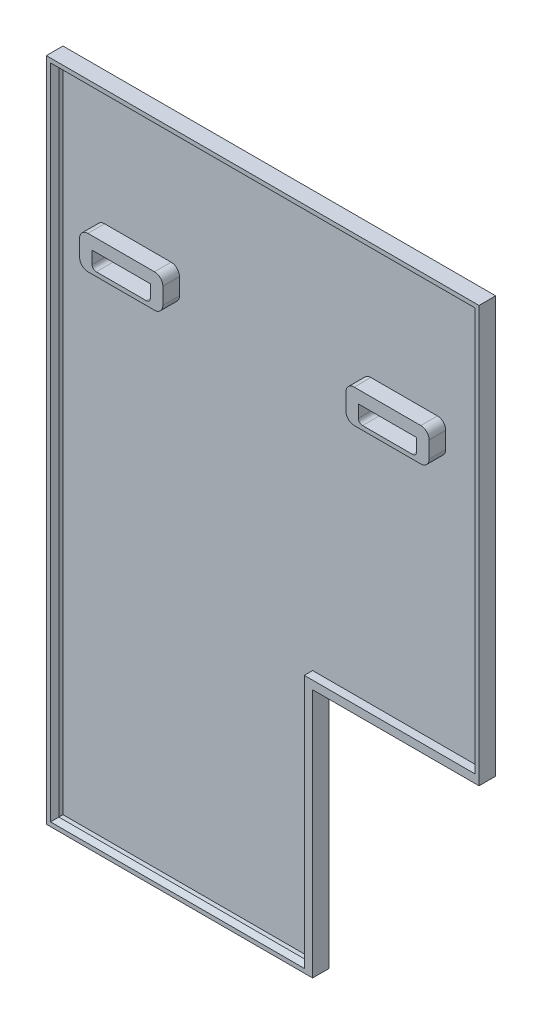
ISO-10303-21;
HEADER;
FILE_DESCRIPTION(('STEP AP214'),'2;1');
FILE_NAME('part.step','',(''),(''),'','','');
FILE_SCHEMA(('AUTOMOTIVE_DESIGN { 1 0 10303 214 1 1 1 1 }'));
ENDSEC;
DATA;
#1=APPLICATION_CONTEXT('core data for automotive mechanical design processes');
#2=APPLICATION_PROTOCOL_DEFINITION('international standard','automotive_design',2000,#1);
#3=PRODUCT_CONTEXT('',#1,'mechanical');
#4=PRODUCT('Part','Part','',(#3));
#5=PRODUCT_RELATED_PRODUCT_CATEGORY('part','',(#4));
#6=PRODUCT_DEFINITION_FORMATION('','',#4);
#7=PRODUCT_DEFINITION_CONTEXT('part definition',#1,'design');
#8=PRODUCT_DEFINITION('design','',#6,#7);
#9=PRODUCT_DEFINITION_SHAPE('','',#8);
#10=(LENGTH_UNIT() NAMED_UNIT(*) SI_UNIT(.MILLI.,.METRE.));
#11=(NAMED_UNIT(*) PLANE_ANGLE_UNIT() SI_UNIT($,.RADIAN.));
#12=(NAMED_UNIT(*) SI_UNIT($,.STERADIAN.) SOLID_ANGLE_UNIT());
#13=UNCERTAINTY_MEASURE_WITH_UNIT(LENGTH_MEASURE(1.E-05),#10,'distance_accuracy_value','');
#14=(GEOMETRIC_REPRESENTATION_CONTEXT(3) GLOBAL_UNCERTAINTY_ASSIGNED_CONTEXT((#13)) GLOBAL_UNIT_ASSIGNED_CONTEXT((#10,
#11,#12)) REPRESENTATION_CONTEXT('',''));
#15=CARTESIAN_POINT('',(0.,0.,0.));
#16=DIRECTION('',(0.,0.,1.));
#17=DIRECTION('',(1.,0.,0.));
#18=AXIS2_PLACEMENT_3D('',#15,#16,#17);
#19=CARTESIAN_POINT('',(0.,-800.,10.));
#20=DIRECTION('',(0.,0.,1.));
#21=DIRECTION('',(1.,0.,0.));
#22=AXIS2_PLACEMENT_3D('',#19,#20,#21);
#23=PLANE('',#22);
#24=DIRECTION('',(0.,1.,0.));
#25=VECTOR('',#24,1.);
#26=CARTESIAN_POINT('',(150.,-160.,10.));
#27=LINE('',#26,#25);
#28=CARTESIAN_POINT('',(150.,-180.,10.));
#29=VERTEX_POINT('',#28);
#30=CARTESIAN_POINT('',(150.,-160.,10.));
#31=VERTEX_POINT('',#30);
#32=EDGE_CURVE('E519',#29,#31,#27,.T.);
#33=ORIENTED_EDGE('',*,*,#32,.F.);
#34=CARTESIAN_POINT('',(140.,-180.,10.));
#35=DIRECTION('',(0.,0.,1.));
#36=DIRECTION('',(-1.,0.,0.));
#37=AXIS2_PLACEMENT_3D('',#34,#35,#36);
#38=CIRCLE('',#37,10.);
#39=CARTESIAN_POINT('',(140.,-190.,10.));
#40=VERTEX_POINT('',#39);
#41=EDGE_CURVE('E497',#40,#29,#38,.T.);
#42=ORIENTED_EDGE('',*,*,#41,.F.);
#43=DIRECTION('',(1.,0.,0.));
#44=VECTOR('',#43,1.);
#45=CARTESIAN_POINT('',(60.,-190.,10.));
#46=LINE('',#45,#44);
#47=CARTESIAN_POINT('',(60.,-190.,10.));
#48=VERTEX_POINT('',#47);
#49=EDGE_CURVE('E502',#48,#40,#46,.T.);
#50=ORIENTED_EDGE('',*,*,#49,.F.);
#51=CARTESIAN_POINT('',(60.,-180.,10.));
#52=DIRECTION('',(0.,0.,1.));
#53=DIRECTION('',(1.,0.,0.));
#54=AXIS2_PLACEMENT_3D('',#51,#52,#53);
#55=CIRCLE('',#54,10.);
#56=CARTESIAN_POINT('',(50.,-180.,10.));
#57=VERTEX_POINT('',#56);
#58=EDGE_CURVE('E529',#57,#48,#55,.T.);
#59=ORIENTED_EDGE('',*,*,#58,.F.);
#60=DIRECTION('',(0.,-1.,0.));
#61=VECTOR('',#60,1.);
#62=CARTESIAN_POINT('',(50.,-160.,10.));
#63=LINE('',#62,#61);
#64=CARTESIAN_POINT('',(50.,-160.,10.));
#65=VERTEX_POINT('',#64);
#66=EDGE_CURVE('E527',#65,#57,#63,.T.);
#67=ORIENTED_EDGE('',*,*,#66,.F.);
#68=CARTESIAN_POINT('',(60.,-160.,10.));
#69=DIRECTION('',(0.,0.,1.));
#70=DIRECTION('',(1.,0.,0.));
#71=AXIS2_PLACEMENT_3D('',#68,#69,#70);
#72=CIRCLE('',#71,10.);
#73=CARTESIAN_POINT('',(60.,-150.,10.));
#74=VERTEX_POINT('',#73);
#75=EDGE_CURVE('E525',#74,#65,#72,.T.);
#76=ORIENTED_EDGE('',*,*,#75,.F.);
#77=DIRECTION('',(-1.,0.,0.));
#78=VECTOR('',#77,1.);
#79=CARTESIAN_POINT('',(60.,-150.,10.));
#80=LINE('',#79,#78);
#81=CARTESIAN_POINT('',(140.,-150.,10.));
#82=VERTEX_POINT('',#81);
#83=EDGE_CURVE('E523',#82,#74,#80,.T.);
#84=ORIENTED_EDGE('',*,*,#83,.F.);
#85=CARTESIAN_POINT('',(140.,-160.,10.));
#86=DIRECTION('',(0.,0.,1.));
#87=DIRECTION('',(1.,0.,0.));
#88=AXIS2_PLACEMENT_3D('',#85,#86,#87);
#89=CIRCLE('',#88,10.);
#90=EDGE_CURVE('E521',#31,#82,#89,.T.);
#91=ORIENTED_EDGE('',*,*,#90,.F.);
#92=EDGE_LOOP('',(#33,#42,#50,#59,#67,#76,#84,#91));
#93=FACE_BOUND('',#92,.T.);
#94=DIRECTION('',(0.,-1.,0.));
#95=VECTOR('',#94,1.);
#96=CARTESIAN_POINT('',(10.,0.,10.));
#97=LINE('',#96,#95);
#98=CARTESIAN_POINT('',(10.,-10.,10.));
#99=VERTEX_POINT('',#98);
#100=CARTESIAN_POINT('',(10.0000000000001,-790.,10.));
#101=VERTEX_POINT('',#100);
#102=EDGE_CURVE('E603',#99,#101,#97,.T.);
#103=ORIENTED_EDGE('',*,*,#102,.T.);
#104=DIRECTION('',(1.,0.,0.));
#105=VECTOR('',#104,1.);
#106=CARTESIAN_POINT('',(0.,-790.,10.));
#107=LINE('',#106,#105);
#108=CARTESIAN_POINT('',(310.,-790.,10.));
#109=VERTEX_POINT('',#108);
#110=EDGE_CURVE('E606',#101,#109,#107,.T.);
#111=ORIENTED_EDGE('',*,*,#110,.T.);
#112=DIRECTION('',(0.,1.,0.));
#113=VECTOR('',#112,1.);
#114=CARTESIAN_POINT('',(310.,-800.,10.));
#115=LINE('',#114,#113);
#116=CARTESIAN_POINT('',(310.,-490.,10.));
#117=VERTEX_POINT('',#116);
#118=EDGE_CURVE('E617',#109,#117,#115,.T.);
#119=ORIENTED_EDGE('',*,*,#118,.T.);
#120=DIRECTION('',(1.,0.,0.));
#121=VECTOR('',#120,1.);
#122=CARTESIAN_POINT('',(320.,-490.,10.));
#123=LINE('',#122,#121);
#124=CARTESIAN_POINT('',(510.,-490.,10.));
#125=VERTEX_POINT('',#124);
#126=EDGE_CURVE('E621',#117,#125,#123,.T.);
#127=ORIENTED_EDGE('',*,*,#126,.T.);
#128=DIRECTION('',(0.,1.,0.));
#129=VECTOR('',#128,1.);
#130=CARTESIAN_POINT('',(510.,0.,10.));
#131=LINE('',#130,#129);
#132=CARTESIAN_POINT('',(510.,-10.,10.));
#133=VERTEX_POINT('',#132);
#134=EDGE_CURVE('E627',#125,#133,#131,.T.);
#135=ORIENTED_EDGE('',*,*,#134,.T.);
#136=DIRECTION('',(-1.,0.,0.));
#137=VECTOR('',#136,1.);
#138=CARTESIAN_POINT('',(0.,-10.,10.));
#139=LINE('',#138,#137);
#140=EDGE_CURVE('E631',#133,#99,#139,.T.);
#141=ORIENTED_EDGE('',*,*,#140,.T.);
#142=EDGE_LOOP('',(#103,#111,#119,#127,#135,#141));
#143=FACE_BOUND('',#142,.T.);
#144=DIRECTION('',(0.,1.,0.));
#145=VECTOR('',#144,1.);
#146=CARTESIAN_POINT('',(470.,-159.999999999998,10.));
#147=LINE('',#146,#145);
#148=CARTESIAN_POINT('',(470.,-179.999999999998,10.));
#149=VERTEX_POINT('',#148);
#150=CARTESIAN_POINT('',(470.,-159.999999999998,10.));
#151=VERTEX_POINT('',#150);
#152=EDGE_CURVE('E462',#149,#151,#147,.T.);
#153=ORIENTED_EDGE('',*,*,#152,.F.);
#154=CARTESIAN_POINT('',(460.,-179.999999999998,10.));
#155=DIRECTION('',(0.,0.,1.));
#156=DIRECTION('',(-1.,0.,0.));
#157=AXIS2_PLACEMENT_3D('',#154,#155,#156);
#158=CIRCLE('',#157,10.);
#159=CARTESIAN_POINT('',(460.,-189.999999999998,10.));
#160=VERTEX_POINT('',#159);
#161=EDGE_CURVE('E431',#160,#149,#158,.T.);
#162=ORIENTED_EDGE('',*,*,#161,.F.);
#163=DIRECTION('',(1.,0.,0.));
#164=VECTOR('',#163,1.);
#165=CARTESIAN_POINT('',(380.,-189.999999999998,10.));
#166=LINE('',#165,#164);
#167=CARTESIAN_POINT('',(380.,-189.999999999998,10.));
#168=VERTEX_POINT('',#167);
#169=EDGE_CURVE('E445',#168,#160,#166,.T.);
#170=ORIENTED_EDGE('',*,*,#169,.F.);
#171=CARTESIAN_POINT('',(380.,-179.999999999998,10.));
#172=DIRECTION('',(0.,0.,1.));
#173=DIRECTION('',(1.,0.,0.));
#174=AXIS2_PLACEMENT_3D('',#171,#172,#173);
#175=CIRCLE('',#174,10.);
#176=CARTESIAN_POINT('',(370.,-179.999999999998,10.));
#177=VERTEX_POINT('',#176);
#178=EDGE_CURVE('E472',#177,#168,#175,.T.);
#179=ORIENTED_EDGE('',*,*,#178,.F.);
#180=DIRECTION('',(0.,-1.,0.));
#181=VECTOR('',#180,1.);
#182=CARTESIAN_POINT('',(370.,-159.999999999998,10.));
#183=LINE('',#182,#181);
#184=CARTESIAN_POINT('',(370.,-159.999999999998,10.));
#185=VERTEX_POINT('',#184);
#186=EDGE_CURVE('E470',#185,#177,#183,.T.);
#187=ORIENTED_EDGE('',*,*,#186,.F.);
#188=CARTESIAN_POINT('',(380.,-159.999999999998,10.));
#189=DIRECTION('',(0.,0.,1.));
#190=DIRECTION('',(-1.,0.,0.));
#191=AXIS2_PLACEMENT_3D('',#188,#189,#190);
#192=CIRCLE('',#191,10.);
#193=CARTESIAN_POINT('',(380.,-149.999999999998,10.));
#194=VERTEX_POINT('',#193);
#195=EDGE_CURVE('E468',#194,#185,#192,.T.);
#196=ORIENTED_EDGE('',*,*,#195,.F.);
#197=DIRECTION('',(-1.,0.,0.));
#198=VECTOR('',#197,1.);
#199=CARTESIAN_POINT('',(380.,-149.999999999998,10.));
#200=LINE('',#199,#198);
#201=CARTESIAN_POINT('',(460.,-149.999999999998,10.));
#202=VERTEX_POINT('',#201);
#203=EDGE_CURVE('E466',#202,#194,#200,.T.);
#204=ORIENTED_EDGE('',*,*,#203,.F.);
#205=CARTESIAN_POINT('',(460.,-159.999999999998,10.));
#206=DIRECTION('',(0.,0.,1.));
#207=DIRECTION('',(1.,0.,0.));
#208=AXIS2_PLACEMENT_3D('',#205,#206,#207);
#209=CIRCLE('',#208,10.);
#210=EDGE_CURVE('E464',#151,#202,#209,.T.);
#211=ORIENTED_EDGE('',*,*,#210,.F.);
#212=EDGE_LOOP('',(#153,#162,#170,#179,#187,#196,#204,#211));
#213=FACE_BOUND('',#212,.T.);
#214=ADVANCED_FACE('F31',(#93,#143,#213),#23,.T.);
#215=CARTESIAN_POINT('',(0.,0.,20.));
#216=DIRECTION('',(1.,0.,0.));
#217=DIRECTION('',(0.,1.,0.));
#218=AXIS2_PLACEMENT_3D('',#215,#216,#217);
#219=PLANE('',#218);
#220=DIRECTION('',(0.,-1.,0.));
#221=VECTOR('',#220,1.);
#222=CARTESIAN_POINT('',(0.,0.,0.));
#223=LINE('',#222,#221);
#224=CARTESIAN_POINT('',(0.,0.,0.));
#225=VERTEX_POINT('',#224);
#226=CARTESIAN_POINT('',(0.,-800.,0.));
#227=VERTEX_POINT('',#226);
#228=EDGE_CURVE('E609',#225,#227,#223,.T.);
#229=ORIENTED_EDGE('',*,*,#228,.T.);
#230=DIRECTION('',(0.,0.,-1.));
#231=VECTOR('',#230,1.);
#232=CARTESIAN_POINT('',(0.,-800.,20.));
#233=LINE('',#232,#231);
#234=CARTESIAN_POINT('',(0.,-800.,20.));
#235=VERTEX_POINT('',#234);
#236=EDGE_CURVE('E678',#235,#227,#233,.T.);
#237=ORIENTED_EDGE('',*,*,#236,.F.);
#238=DIRECTION('',(0.,-1.,0.));
#239=VECTOR('',#238,1.);
#240=CARTESIAN_POINT('',(0.,0.,20.));
#241=LINE('',#240,#239);
#242=CARTESIAN_POINT('',(0.,0.,20.));
#243=VERTEX_POINT('',#242);
#244=EDGE_CURVE('E638',#243,#235,#241,.T.);
#245=ORIENTED_EDGE('',*,*,#244,.F.);
#246=DIRECTION('',(0.,0.,-1.));
#247=VECTOR('',#246,1.);
#248=CARTESIAN_POINT('',(0.,0.,20.));
#249=LINE('',#248,#247);
#250=EDGE_CURVE('E652',#243,#225,#249,.T.);
#251=ORIENTED_EDGE('',*,*,#250,.T.);
#252=EDGE_LOOP('',(#229,#237,#245,#251));
#253=FACE_BOUND('',#252,.T.);
#254=ADVANCED_FACE('F763',(#253),#219,.F.);
#255=CARTESIAN_POINT('',(0.,-800.,20.));
#256=DIRECTION('',(0.,1.,0.));
#257=DIRECTION('',(0.,0.,1.));
#258=AXIS2_PLACEMENT_3D('',#255,#256,#257);
#259=PLANE('',#258);
#260=DIRECTION('',(1.,0.,0.));
#261=VECTOR('',#260,1.);
#262=CARTESIAN_POINT('',(0.,-800.,0.));
#263=LINE('',#262,#261);
#264=CARTESIAN_POINT('',(320.,-800.,0.));
#265=VERTEX_POINT('',#264);
#266=EDGE_CURVE('E655',#227,#265,#263,.T.);
#267=ORIENTED_EDGE('',*,*,#266,.T.);
#268=DIRECTION('',(0.,0.,-1.));
#269=VECTOR('',#268,1.);
#270=CARTESIAN_POINT('',(320.,-800.,20.));
#271=LINE('',#270,#269);
#272=CARTESIAN_POINT('',(320.,-800.,20.));
#273=VERTEX_POINT('',#272);
#274=EDGE_CURVE('E675',#273,#265,#271,.T.);
#275=ORIENTED_EDGE('',*,*,#274,.F.);
#276=DIRECTION('',(1.,0.,0.));
#277=VECTOR('',#276,1.);
#278=CARTESIAN_POINT('',(0.,-800.,20.));
#279=LINE('',#278,#277);
#280=EDGE_CURVE('E641',#235,#273,#279,.T.);
#281=ORIENTED_EDGE('',*,*,#280,.F.);
#282=ORIENTED_EDGE('',*,*,#236,.T.);
#283=EDGE_LOOP('',(#267,#275,#281,#282));
#284=FACE_BOUND('',#283,.T.);
#285=ADVANCED_FACE('F769',(#284),#259,.F.);
#286=CARTESIAN_POINT('',(320.,-800.,20.));
#287=DIRECTION('',(-1.,0.,0.));
#288=DIRECTION('',(0.,0.,1.));
#289=AXIS2_PLACEMENT_3D('',#286,#287,#288);
#290=PLANE('',#289);
#291=DIRECTION('',(0.,1.,0.));
#292=VECTOR('',#291,1.);
#293=CARTESIAN_POINT('',(320.,-800.,0.));
#294=LINE('',#293,#292);
#295=CARTESIAN_POINT('',(320.,-500.,0.));
#296=VERTEX_POINT('',#295);
#297=EDGE_CURVE('E657',#265,#296,#294,.T.);
#298=ORIENTED_EDGE('',*,*,#297,.T.);
#299=DIRECTION('',(0.,0.,-1.));
#300=VECTOR('',#299,1.);
#301=CARTESIAN_POINT('',(320.,-500.,20.));
#302=LINE('',#301,#300);
#303=CARTESIAN_POINT('',(320.,-500.,20.));
#304=VERTEX_POINT('',#303);
#305=EDGE_CURVE('E672',#304,#296,#302,.T.);
#306=ORIENTED_EDGE('',*,*,#305,.F.);
#307=DIRECTION('',(0.,1.,0.));
#308=VECTOR('',#307,1.);
#309=CARTESIAN_POINT('',(320.,-800.,20.));
#310=LINE('',#309,#308);
#311=EDGE_CURVE('E644',#273,#304,#310,.T.);
#312=ORIENTED_EDGE('',*,*,#311,.F.);
#313=ORIENTED_EDGE('',*,*,#274,.T.);
#314=EDGE_LOOP('',(#298,#306,#312,#313));
#315=FACE_BOUND('',#314,.T.);
#316=ADVANCED_FACE('F792',(#315),#290,.F.);
#317=CARTESIAN_POINT('',(320.,-500.,20.));
#318=DIRECTION('',(0.,1.,0.));
#319=DIRECTION('',(0.,0.,1.));
#320=AXIS2_PLACEMENT_3D('',#317,#318,#319);
#321=PLANE('',#320);
#322=DIRECTION('',(1.,0.,0.));
#323=VECTOR('',#322,1.);
#324=CARTESIAN_POINT('',(320.,-500.,0.));
#325=LINE('',#324,#323);
#326=CARTESIAN_POINT('',(520.,-500.,0.));
#327=VERTEX_POINT('',#326);
#328=EDGE_CURVE('E659',#296,#327,#325,.T.);
#329=ORIENTED_EDGE('',*,*,#328,.T.);
#330=DIRECTION('',(0.,0.,-1.));
#331=VECTOR('',#330,1.);
#332=CARTESIAN_POINT('',(520.,-500.,20.));
#333=LINE('',#332,#331);
#334=CARTESIAN_POINT('',(520.,-500.,20.));
#335=VERTEX_POINT('',#334);
#336=EDGE_CURVE('E669',#335,#327,#333,.T.);
#337=ORIENTED_EDGE('',*,*,#336,.F.);
#338=DIRECTION('',(1.,0.,0.));
#339=VECTOR('',#338,1.);
#340=CARTESIAN_POINT('',(320.,-500.,20.));
#341=LINE('',#340,#339);
#342=EDGE_CURVE('E646',#304,#335,#341,.T.);
#343=ORIENTED_EDGE('',*,*,#342,.F.);
#344=ORIENTED_EDGE('',*,*,#305,.T.);
#345=EDGE_LOOP('',(#329,#337,#343,#344));
#346=FACE_BOUND('',#345,.T.);
#347=ADVANCED_FACE('F788',(#346),#321,.F.);
#348=CARTESIAN_POINT('',(520.,0.,20.));
#349=DIRECTION('',(-1.,0.,0.));
#350=DIRECTION('',(0.,-1.,0.));
#351=AXIS2_PLACEMENT_3D('',#348,#349,#350);
#352=PLANE('',#351);
#353=DIRECTION('',(0.,1.,0.));
#354=VECTOR('',#353,1.);
#355=CARTESIAN_POINT('',(520.,0.,0.));
#356=LINE('',#355,#354);
#357=CARTESIAN_POINT('',(520.,0.,0.));
#358=VERTEX_POINT('',#357);
#359=EDGE_CURVE('E661',#327,#358,#356,.T.);
#360=ORIENTED_EDGE('',*,*,#359,.T.);
#361=DIRECTION('',(0.,0.,-1.));
#362=VECTOR('',#361,1.);
#363=CARTESIAN_POINT('',(520.,0.,20.));
#364=LINE('',#363,#362);
#365=CARTESIAN_POINT('',(520.,0.,20.));
#366=VERTEX_POINT('',#365);
#367=EDGE_CURVE('E666',#366,#358,#364,.T.);
#368=ORIENTED_EDGE('',*,*,#367,.F.);
#369=DIRECTION('',(0.,1.,0.));
#370=VECTOR('',#369,1.);
#371=CARTESIAN_POINT('',(520.,0.,20.));
#372=LINE('',#371,#370);
#373=EDGE_CURVE('E648',#335,#366,#372,.T.);
#374=ORIENTED_EDGE('',*,*,#373,.F.);
#375=ORIENTED_EDGE('',*,*,#336,.T.);
#376=EDGE_LOOP('',(#360,#368,#374,#375));
#377=FACE_BOUND('',#376,.T.);
#378=ADVANCED_FACE('F784',(#377),#352,.F.);
#379=CARTESIAN_POINT('',(0.,0.,20.));
#380=DIRECTION('',(0.,-1.,0.));
#381=DIRECTION('',(0.,0.,-1.));
#382=AXIS2_PLACEMENT_3D('',#379,#380,#381);
#383=PLANE('',#382);
#384=DIRECTION('',(-1.,0.,0.));
#385=VECTOR('',#384,1.);
#386=CARTESIAN_POINT('',(0.,0.,0.));
#387=LINE('',#386,#385);
#388=EDGE_CURVE('E642',#358,#225,#387,.T.);
#389=ORIENTED_EDGE('',*,*,#388,.T.);
#390=ORIENTED_EDGE('',*,*,#250,.F.);
#391=DIRECTION('',(-1.,0.,0.));
#392=VECTOR('',#391,1.);
#393=CARTESIAN_POINT('',(0.,0.,20.));
#394=LINE('',#393,#392);
#395=EDGE_CURVE('E650',#366,#243,#394,.T.);
#396=ORIENTED_EDGE('',*,*,#395,.F.);
#397=ORIENTED_EDGE('',*,*,#367,.T.);
#398=EDGE_LOOP('',(#389,#390,#396,#397));
#399=FACE_BOUND('',#398,.T.);
#400=ADVANCED_FACE('F778',(#399),#383,.F.);
#401=CARTESIAN_POINT('',(0.,-800.,20.));
#402=DIRECTION('',(0.,0.,1.));
#403=DIRECTION('',(1.,0.,0.));
#404=AXIS2_PLACEMENT_3D('',#401,#402,#403);
#405=PLANE('',#404);
#406=DIRECTION('',(0.,-1.,0.));
#407=VECTOR('',#406,1.);
#408=CARTESIAN_POINT('',(515.,-800.,20.));
#409=LINE('',#408,#407);
#410=CARTESIAN_POINT('',(515.,-5.,20.));
#411=VERTEX_POINT('',#410);
#412=CARTESIAN_POINT('',(515.,-490.,20.));
#413=VERTEX_POINT('',#412);
#414=EDGE_CURVE('E688',#411,#413,#409,.T.);
#415=ORIENTED_EDGE('',*,*,#414,.T.);
#416=DIRECTION('',(1.,0.,0.));
#417=VECTOR('',#416,1.);
#418=CARTESIAN_POINT('',(320.,-490.,20.));
#419=LINE('',#418,#417);
#420=CARTESIAN_POINT('',(310.,-490.,20.));
#421=VERTEX_POINT('',#420);
#422=EDGE_CURVE('E614',#421,#413,#419,.T.);
#423=ORIENTED_EDGE('',*,*,#422,.F.);
#424=DIRECTION('',(0.,1.,0.));
#425=VECTOR('',#424,1.);
#426=CARTESIAN_POINT('',(310.,-800.,20.));
#427=LINE('',#426,#425);
#428=CARTESIAN_POINT('',(310.,-795.,20.));
#429=VERTEX_POINT('',#428);
#430=EDGE_CURVE('E635',#429,#421,#427,.T.);
#431=ORIENTED_EDGE('',*,*,#430,.F.);
#432=DIRECTION('',(-1.,0.,0.));
#433=VECTOR('',#432,1.);
#434=CARTESIAN_POINT('',(0.,-795.,20.));
#435=LINE('',#434,#433);
#436=CARTESIAN_POINT('',(5.00000000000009,-795.,20.));
#437=VERTEX_POINT('',#436);
#438=EDGE_CURVE('E691',#429,#437,#435,.T.);
#439=ORIENTED_EDGE('',*,*,#438,.T.);
#440=DIRECTION('',(0.,1.,0.));
#441=VECTOR('',#440,1.);
#442=CARTESIAN_POINT('',(5.0000000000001,-800.,20.));
#443=LINE('',#442,#441);
#444=CARTESIAN_POINT('',(5.,-5.,20.));
#445=VERTEX_POINT('',#444);
#446=EDGE_CURVE('E686',#437,#445,#443,.T.);
#447=ORIENTED_EDGE('',*,*,#446,.T.);
#448=DIRECTION('',(1.,0.,0.));
#449=VECTOR('',#448,1.);
#450=CARTESIAN_POINT('',(0.,-5.,20.));
#451=LINE('',#450,#449);
#452=EDGE_CURVE('E684',#445,#411,#451,.T.);
#453=ORIENTED_EDGE('',*,*,#452,.T.);
#454=EDGE_LOOP('',(#415,#423,#431,#439,#447,#453));
#455=FACE_BOUND('',#454,.T.);
#456=ORIENTED_EDGE('',*,*,#244,.T.);
#457=ORIENTED_EDGE('',*,*,#280,.T.);
#458=ORIENTED_EDGE('',*,*,#311,.T.);
#459=ORIENTED_EDGE('',*,*,#342,.T.);
#460=ORIENTED_EDGE('',*,*,#373,.T.);
#461=ORIENTED_EDGE('',*,*,#395,.T.);
#462=EDGE_LOOP('',(#456,#457,#458,#459,#460,#461));
#463=FACE_BOUND('',#462,.T.);
#464=ADVANCED_FACE('F720',(#455,#463),#405,.T.);
#465=CARTESIAN_POINT('',(0.,-800.,0.));
#466=DIRECTION('',(0.,0.,1.));
#467=DIRECTION('',(1.,0.,0.));
#468=AXIS2_PLACEMENT_3D('',#465,#466,#467);
#469=PLANE('',#468);
#470=DIRECTION('',(-1.,0.,0.));
#471=VECTOR('',#470,1.);
#472=CARTESIAN_POINT('',(0.,-10.,0.));
#473=LINE('',#472,#471);
#474=CARTESIAN_POINT('',(510.,-10.,0.));
#475=VERTEX_POINT('',#474);
#476=CARTESIAN_POINT('',(10.,-10.,0.));
#477=VERTEX_POINT('',#476);
#478=EDGE_CURVE('E562',#475,#477,#473,.T.);
#479=ORIENTED_EDGE('',*,*,#478,.T.);
#480=DIRECTION('',(0.,-1.,0.));
#481=VECTOR('',#480,1.);
#482=CARTESIAN_POINT('',(10.,0.,0.));
#483=LINE('',#482,#481);
#484=CARTESIAN_POINT('',(10.0000000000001,-790.,0.));
#485=VERTEX_POINT('',#484);
#486=EDGE_CURVE('E570',#477,#485,#483,.T.);
#487=ORIENTED_EDGE('',*,*,#486,.T.);
#488=DIRECTION('',(1.,0.,0.));
#489=VECTOR('',#488,1.);
#490=CARTESIAN_POINT('',(0.,-790.,0.));
#491=LINE('',#490,#489);
#492=CARTESIAN_POINT('',(310.,-790.,0.));
#493=VERTEX_POINT('',#492);
#494=EDGE_CURVE('E573',#485,#493,#491,.T.);
#495=ORIENTED_EDGE('',*,*,#494,.T.);
#496=DIRECTION('',(0.,1.,0.));
#497=VECTOR('',#496,1.);
#498=CARTESIAN_POINT('',(310.,-800.,0.));
#499=LINE('',#498,#497);
#500=CARTESIAN_POINT('',(310.,-490.,0.));
#501=VERTEX_POINT('',#500);
#502=EDGE_CURVE('E582',#493,#501,#499,.T.);
#503=ORIENTED_EDGE('',*,*,#502,.T.);
#504=DIRECTION('',(1.,0.,0.));
#505=VECTOR('',#504,1.);
#506=CARTESIAN_POINT('',(320.,-490.,0.));
#507=LINE('',#506,#505);
#508=CARTESIAN_POINT('',(510.,-490.,0.));
#509=VERTEX_POINT('',#508);
#510=EDGE_CURVE('E579',#501,#509,#507,.T.);
#511=ORIENTED_EDGE('',*,*,#510,.T.);
#512=DIRECTION('',(0.,1.,0.));
#513=VECTOR('',#512,1.);
#514=CARTESIAN_POINT('',(510.,0.,0.));
#515=LINE('',#514,#513);
#516=EDGE_CURVE('E576',#509,#475,#515,.T.);
#517=ORIENTED_EDGE('',*,*,#516,.T.);
#518=EDGE_LOOP('',(#479,#487,#495,#503,#511,#517));
#519=FACE_BOUND('',#518,.T.);
#520=ORIENTED_EDGE('',*,*,#228,.F.);
#521=ORIENTED_EDGE('',*,*,#388,.F.);
#522=ORIENTED_EDGE('',*,*,#359,.F.);
#523=ORIENTED_EDGE('',*,*,#328,.F.);
#524=ORIENTED_EDGE('',*,*,#297,.F.);
#525=ORIENTED_EDGE('',*,*,#266,.F.);
#526=EDGE_LOOP('',(#520,#521,#522,#523,#524,#525));
#527=FACE_BOUND('',#526,.T.);
#528=ADVANCED_FACE('F777',(#519,#527),#469,.F.);
#529=CARTESIAN_POINT('',(10.,0.,20.));
#530=DIRECTION('',(1.,0.,0.));
#531=DIRECTION('',(0.,1.,0.));
#532=AXIS2_PLACEMENT_3D('',#529,#530,#531);
#533=PLANE('',#532);
#534=DIRECTION('',(0.,0.,-1.));
#535=VECTOR('',#534,1.);
#536=CARTESIAN_POINT('',(10.,-10.,20.));
#537=LINE('',#536,#535);
#538=CARTESIAN_POINT('',(10.,-10.,15.));
#539=VERTEX_POINT('',#538);
#540=EDGE_CURVE('E611',#539,#99,#537,.T.);
#541=ORIENTED_EDGE('',*,*,#540,.F.);
#542=DIRECTION('',(0.,-1.,0.));
#543=VECTOR('',#542,1.);
#544=CARTESIAN_POINT('',(10.,0.,15.));
#545=LINE('',#544,#543);
#546=CARTESIAN_POINT('',(10.0000000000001,-790.,15.));
#547=VERTEX_POINT('',#546);
#548=EDGE_CURVE('E695',#539,#547,#545,.T.);
#549=ORIENTED_EDGE('',*,*,#548,.T.);
#550=DIRECTION('',(0.,0.,-1.));
#551=VECTOR('',#550,1.);
#552=CARTESIAN_POINT('',(10.0000000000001,-790.,20.));
#553=LINE('',#552,#551);
#554=EDGE_CURVE('E607',#547,#101,#553,.T.);
#555=ORIENTED_EDGE('',*,*,#554,.T.);
#556=ORIENTED_EDGE('',*,*,#102,.F.);
#557=EDGE_LOOP('',(#541,#549,#555,#556));
#558=FACE_BOUND('',#557,.T.);
#559=ADVANCED_FACE('F745',(#558),#533,.T.);
#560=CARTESIAN_POINT('',(0.,-790.,20.));
#561=DIRECTION('',(0.,1.,0.));
#562=DIRECTION('',(0.,0.,1.));
#563=AXIS2_PLACEMENT_3D('',#560,#561,#562);
#564=PLANE('',#563);
#565=ORIENTED_EDGE('',*,*,#554,.F.);
#566=DIRECTION('',(1.,0.,0.));
#567=VECTOR('',#566,1.);
#568=CARTESIAN_POINT('',(0.,-790.,15.));
#569=LINE('',#568,#567);
#570=CARTESIAN_POINT('',(310.,-790.,15.));
#571=VERTEX_POINT('',#570);
#572=EDGE_CURVE('E681',#547,#571,#569,.T.);
#573=ORIENTED_EDGE('',*,*,#572,.T.);
#574=DIRECTION('',(0.,0.,-1.));
#575=VECTOR('',#574,1.);
#576=CARTESIAN_POINT('',(310.,-790.,20.));
#577=LINE('',#576,#575);
#578=EDGE_CURVE('E610',#571,#109,#577,.T.);
#579=ORIENTED_EDGE('',*,*,#578,.T.);
#580=ORIENTED_EDGE('',*,*,#110,.F.);
#581=EDGE_LOOP('',(#565,#573,#579,#580));
#582=FACE_BOUND('',#581,.T.);
#583=ADVANCED_FACE('F731',(#582),#564,.T.);
#584=CARTESIAN_POINT('',(310.,-800.,20.));
#585=DIRECTION('',(-1.,0.,0.));
#586=DIRECTION('',(0.,0.,1.));
#587=AXIS2_PLACEMENT_3D('',#584,#585,#586);
#588=PLANE('',#587);
#589=ORIENTED_EDGE('',*,*,#118,.F.);
#590=ORIENTED_EDGE('',*,*,#578,.F.);
#591=DIRECTION('',(0.,0.707106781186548,-0.707106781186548));
#592=VECTOR('',#591,1.);
#593=CARTESIAN_POINT('',(310.,-790.,15.));
#594=LINE('',#593,#592);
#595=EDGE_CURVE('E40',#571,#429,#594,.F.);
#596=ORIENTED_EDGE('',*,*,#595,.T.);
#597=ORIENTED_EDGE('',*,*,#430,.T.);
#598=DIRECTION('',(0.,0.,-1.));
#599=VECTOR('',#598,1.);
#600=CARTESIAN_POINT('',(310.,-490.,20.));
#601=LINE('',#600,#599);
#602=EDGE_CURVE('E619',#421,#117,#601,.T.);
#603=ORIENTED_EDGE('',*,*,#602,.T.);
#604=EDGE_LOOP('',(#589,#590,#596,#597,#603));
#605=FACE_BOUND('',#604,.T.);
#606=ADVANCED_FACE('F735',(#605),#588,.T.);
#607=CARTESIAN_POINT('',(320.,-490.,20.));
#608=DIRECTION('',(0.,1.,0.));
#609=DIRECTION('',(0.,0.,1.));
#610=AXIS2_PLACEMENT_3D('',#607,#608,#609);
#611=PLANE('',#610);
#612=ORIENTED_EDGE('',*,*,#126,.F.);
#613=ORIENTED_EDGE('',*,*,#602,.F.);
#614=ORIENTED_EDGE('',*,*,#422,.T.);
#615=DIRECTION('',(0.707106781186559,0.,0.707106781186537));
#616=VECTOR('',#615,1.);
#617=CARTESIAN_POINT('',(510.,-490.,14.9999999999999));
#618=LINE('',#617,#616);
#619=CARTESIAN_POINT('',(510.,-490.,15.));
#620=VERTEX_POINT('',#619);
#621=EDGE_CURVE('E11',#413,#620,#618,.F.);
#622=ORIENTED_EDGE('',*,*,#621,.T.);
#623=DIRECTION('',(0.,0.,-1.));
#624=VECTOR('',#623,1.);
#625=CARTESIAN_POINT('',(510.,-490.,20.));
#626=LINE('',#625,#624);
#627=EDGE_CURVE('E624',#620,#125,#626,.T.);
#628=ORIENTED_EDGE('',*,*,#627,.T.);
#629=EDGE_LOOP('',(#612,#613,#614,#622,#628));
#630=FACE_BOUND('',#629,.T.);
#631=ADVANCED_FACE('F753',(#630),#611,.T.);
#632=CARTESIAN_POINT('',(510.,0.,20.));
#633=DIRECTION('',(-1.,0.,0.));
#634=DIRECTION('',(0.,-1.,0.));
#635=AXIS2_PLACEMENT_3D('',#632,#633,#634);
#636=PLANE('',#635);
#637=ORIENTED_EDGE('',*,*,#627,.F.);
#638=DIRECTION('',(0.,1.,0.));
#639=VECTOR('',#638,1.);
#640=CARTESIAN_POINT('',(510.,0.,15.));
#641=LINE('',#640,#639);
#642=CARTESIAN_POINT('',(510.,-10.,15.));
#643=VERTEX_POINT('',#642);
#644=EDGE_CURVE('E693',#620,#643,#641,.T.);
#645=ORIENTED_EDGE('',*,*,#644,.T.);
#646=DIRECTION('',(0.,0.,-1.));
#647=VECTOR('',#646,1.);
#648=CARTESIAN_POINT('',(510.,-10.,20.));
#649=LINE('',#648,#647);
#650=EDGE_CURVE('E613',#643,#133,#649,.T.);
#651=ORIENTED_EDGE('',*,*,#650,.T.);
#652=ORIENTED_EDGE('',*,*,#134,.F.);
#653=EDGE_LOOP('',(#637,#645,#651,#652));
#654=FACE_BOUND('',#653,.T.);
#655=ADVANCED_FACE('F751',(#654),#636,.T.);
#656=CARTESIAN_POINT('',(0.,-10.,20.));
#657=DIRECTION('',(0.,-1.,0.));
#658=DIRECTION('',(0.,0.,-1.));
#659=AXIS2_PLACEMENT_3D('',#656,#657,#658);
#660=PLANE('',#659);
#661=ORIENTED_EDGE('',*,*,#650,.F.);
#662=DIRECTION('',(-1.,0.,0.));
#663=VECTOR('',#662,1.);
#664=CARTESIAN_POINT('',(0.,-10.,15.));
#665=LINE('',#664,#663);
#666=EDGE_CURVE('E697',#643,#539,#665,.T.);
#667=ORIENTED_EDGE('',*,*,#666,.T.);
#668=ORIENTED_EDGE('',*,*,#540,.T.);
#669=ORIENTED_EDGE('',*,*,#140,.F.);
#670=EDGE_LOOP('',(#661,#667,#668,#669));
#671=FACE_BOUND('',#670,.T.);
#672=ADVANCED_FACE('F748',(#671),#660,.T.);
#673=CARTESIAN_POINT('',(0.,-800.,2.));
#674=DIRECTION('',(0.,0.,1.));
#675=DIRECTION('',(1.,0.,0.));
#676=AXIS2_PLACEMENT_3D('',#673,#674,#675);
#677=PLANE('',#676);
#678=DIRECTION('',(0.,1.,0.));
#679=VECTOR('',#678,1.);
#680=CARTESIAN_POINT('',(510.,0.,2.));
#681=LINE('',#680,#679);
#682=CARTESIAN_POINT('',(510.,-490.,2.));
#683=VERTEX_POINT('',#682);
#684=CARTESIAN_POINT('',(510.,-10.,2.));
#685=VERTEX_POINT('',#684);
#686=EDGE_CURVE('E598',#683,#685,#681,.T.);
#687=ORIENTED_EDGE('',*,*,#686,.F.);
#688=DIRECTION('',(1.,0.,0.));
#689=VECTOR('',#688,1.);
#690=CARTESIAN_POINT('',(320.,-490.,2.));
#691=LINE('',#690,#689);
#692=CARTESIAN_POINT('',(310.,-490.,2.));
#693=VERTEX_POINT('',#692);
#694=EDGE_CURVE('E595',#693,#683,#691,.T.);
#695=ORIENTED_EDGE('',*,*,#694,.F.);
#696=DIRECTION('',(0.,1.,0.));
#697=VECTOR('',#696,1.);
#698=CARTESIAN_POINT('',(310.,-800.,2.));
#699=LINE('',#698,#697);
#700=CARTESIAN_POINT('',(310.,-790.,2.));
#701=VERTEX_POINT('',#700);
#702=EDGE_CURVE('E592',#701,#693,#699,.T.);
#703=ORIENTED_EDGE('',*,*,#702,.F.);
#704=DIRECTION('',(1.,0.,0.));
#705=VECTOR('',#704,1.);
#706=CARTESIAN_POINT('',(0.,-790.,2.));
#707=LINE('',#706,#705);
#708=CARTESIAN_POINT('',(10.0000000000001,-790.,2.));
#709=VERTEX_POINT('',#708);
#710=EDGE_CURVE('E589',#709,#701,#707,.T.);
#711=ORIENTED_EDGE('',*,*,#710,.F.);
#712=DIRECTION('',(0.,-1.,0.));
#713=VECTOR('',#712,1.);
#714=CARTESIAN_POINT('',(10.,0.,2.));
#715=LINE('',#714,#713);
#716=CARTESIAN_POINT('',(10.,-10.,2.));
#717=VERTEX_POINT('',#716);
#718=EDGE_CURVE('E557',#717,#709,#715,.T.);
#719=ORIENTED_EDGE('',*,*,#718,.F.);
#720=DIRECTION('',(-1.,0.,0.));
#721=VECTOR('',#720,1.);
#722=CARTESIAN_POINT('',(0.,-10.,2.));
#723=LINE('',#722,#721);
#724=EDGE_CURVE('E601',#685,#717,#723,.T.);
#725=ORIENTED_EDGE('',*,*,#724,.F.);
#726=EDGE_LOOP('',(#687,#695,#703,#711,#719,#725));
#727=FACE_BOUND('',#726,.T.);
#728=ADVANCED_FACE('F823',(#727),#677,.F.);
#729=CARTESIAN_POINT('',(10.,0.,20.));
#730=DIRECTION('',(1.,0.,0.));
#731=DIRECTION('',(0.,1.,0.));
#732=AXIS2_PLACEMENT_3D('',#729,#730,#731);
#733=PLANE('',#732);
#734=ORIENTED_EDGE('',*,*,#718,.T.);
#735=DIRECTION('',(0.,0.,-1.));
#736=VECTOR('',#735,1.);
#737=CARTESIAN_POINT('',(10.0000000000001,-790.,20.));
#738=LINE('',#737,#736);
#739=EDGE_CURVE('E555',#709,#485,#738,.T.);
#740=ORIENTED_EDGE('',*,*,#739,.T.);
#741=ORIENTED_EDGE('',*,*,#486,.F.);
#742=DIRECTION('',(0.,0.,-1.));
#743=VECTOR('',#742,1.);
#744=CARTESIAN_POINT('',(10.,-10.,20.));
#745=LINE('',#744,#743);
#746=EDGE_CURVE('E559',#717,#477,#745,.T.);
#747=ORIENTED_EDGE('',*,*,#746,.F.);
#748=EDGE_LOOP('',(#734,#740,#741,#747));
#749=FACE_BOUND('',#748,.T.);
#750=ADVANCED_FACE('F826',(#749),#733,.T.);
#751=CARTESIAN_POINT('',(0.,-790.,20.));
#752=DIRECTION('',(0.,1.,0.));
#753=DIRECTION('',(0.,0.,1.));
#754=AXIS2_PLACEMENT_3D('',#751,#752,#753);
#755=PLANE('',#754);
#756=ORIENTED_EDGE('',*,*,#710,.T.);
#757=DIRECTION('',(0.,0.,-1.));
#758=VECTOR('',#757,1.);
#759=CARTESIAN_POINT('',(310.,-790.,20.));
#760=LINE('',#759,#758);
#761=EDGE_CURVE('E558',#701,#493,#760,.T.);
#762=ORIENTED_EDGE('',*,*,#761,.T.);
#763=ORIENTED_EDGE('',*,*,#494,.F.);
#764=ORIENTED_EDGE('',*,*,#739,.F.);
#765=EDGE_LOOP('',(#756,#762,#763,#764));
#766=FACE_BOUND('',#765,.T.);
#767=ADVANCED_FACE('F1201',(#766),#755,.T.);
#768=CARTESIAN_POINT('',(310.,-800.,20.));
#769=DIRECTION('',(-1.,0.,0.));
#770=DIRECTION('',(0.,0.,1.));
#771=AXIS2_PLACEMENT_3D('',#768,#769,#770);
#772=PLANE('',#771);
#773=ORIENTED_EDGE('',*,*,#702,.T.);
#774=DIRECTION('',(0.,0.,-1.));
#775=VECTOR('',#774,1.);
#776=CARTESIAN_POINT('',(310.,-490.,20.));
#777=LINE('',#776,#775);
#778=EDGE_CURVE('E565',#693,#501,#777,.T.);
#779=ORIENTED_EDGE('',*,*,#778,.T.);
#780=ORIENTED_EDGE('',*,*,#502,.F.);
#781=ORIENTED_EDGE('',*,*,#761,.F.);
#782=EDGE_LOOP('',(#773,#779,#780,#781));
#783=FACE_BOUND('',#782,.T.);
#784=ADVANCED_FACE('F1205',(#783),#772,.T.);
#785=CARTESIAN_POINT('',(320.,-490.,20.));
#786=DIRECTION('',(0.,1.,0.));
#787=DIRECTION('',(0.,0.,1.));
#788=AXIS2_PLACEMENT_3D('',#785,#786,#787);
#789=PLANE('',#788);
#790=ORIENTED_EDGE('',*,*,#694,.T.);
#791=DIRECTION('',(0.,0.,-1.));
#792=VECTOR('',#791,1.);
#793=CARTESIAN_POINT('',(510.,-490.,20.));
#794=LINE('',#793,#792);
#795=EDGE_CURVE('E567',#683,#509,#794,.T.);
#796=ORIENTED_EDGE('',*,*,#795,.T.);
#797=ORIENTED_EDGE('',*,*,#510,.F.);
#798=ORIENTED_EDGE('',*,*,#778,.F.);
#799=EDGE_LOOP('',(#790,#796,#797,#798));
#800=FACE_BOUND('',#799,.T.);
#801=ADVANCED_FACE('F818',(#800),#789,.T.);
#802=CARTESIAN_POINT('',(510.,0.,20.));
#803=DIRECTION('',(-1.,0.,0.));
#804=DIRECTION('',(0.,-1.,0.));
#805=AXIS2_PLACEMENT_3D('',#802,#803,#804);
#806=PLANE('',#805);
#807=ORIENTED_EDGE('',*,*,#686,.T.);
#808=DIRECTION('',(0.,0.,-1.));
#809=VECTOR('',#808,1.);
#810=CARTESIAN_POINT('',(510.,-10.,20.));
#811=LINE('',#810,#809);
#812=EDGE_CURVE('E561',#685,#475,#811,.T.);
#813=ORIENTED_EDGE('',*,*,#812,.T.);
#814=ORIENTED_EDGE('',*,*,#516,.F.);
#815=ORIENTED_EDGE('',*,*,#795,.F.);
#816=EDGE_LOOP('',(#807,#813,#814,#815));
#817=FACE_BOUND('',#816,.T.);
#818=ADVANCED_FACE('F812',(#817),#806,.T.);
#819=CARTESIAN_POINT('',(0.,-10.,20.));
#820=DIRECTION('',(0.,-1.,0.));
#821=DIRECTION('',(0.,0.,-1.));
#822=AXIS2_PLACEMENT_3D('',#819,#820,#821);
#823=PLANE('',#822);
#824=ORIENTED_EDGE('',*,*,#724,.T.);
#825=ORIENTED_EDGE('',*,*,#746,.T.);
#826=ORIENTED_EDGE('',*,*,#478,.F.);
#827=ORIENTED_EDGE('',*,*,#812,.F.);
#828=EDGE_LOOP('',(#824,#825,#826,#827));
#829=FACE_BOUND('',#828,.T.);
#830=ADVANCED_FACE('F808',(#829),#823,.T.);
#831=CARTESIAN_POINT('',(510.,0.,15.));
#832=DIRECTION('',(0.707106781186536,0.,-0.707106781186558));
#833=DIRECTION('',(-0.707106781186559,0.,-0.707106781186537));
#834=AXIS2_PLACEMENT_3D('',#831,#832,#833);
#835=PLANE('',#834);
#836=ORIENTED_EDGE('',*,*,#621,.F.);
#837=ORIENTED_EDGE('',*,*,#414,.F.);
#838=DIRECTION('',(0.577350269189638,0.577350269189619,0.57735026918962));
#839=VECTOR('',#838,1.);
#840=CARTESIAN_POINT('',(513.333333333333,-6.66666666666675,18.3333333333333));
#841=LINE('',#840,#839);
#842=EDGE_CURVE('E35',#643,#411,#841,.T.);
#843=ORIENTED_EDGE('',*,*,#842,.F.);
#844=ORIENTED_EDGE('',*,*,#644,.F.);
#845=EDGE_LOOP('',(#836,#837,#843,#844));
#846=FACE_BOUND('',#845,.T.);
#847=ADVANCED_FACE('F33',(#846),#835,.F.);
#848=CARTESIAN_POINT('',(0.,-10.,15.));
#849=DIRECTION('',(0.,0.707106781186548,-0.707106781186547));
#850=DIRECTION('',(0.,0.707106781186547,0.707106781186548));
#851=AXIS2_PLACEMENT_3D('',#848,#849,#850);
#852=PLANE('',#851);
#853=ORIENTED_EDGE('',*,*,#842,.T.);
#854=ORIENTED_EDGE('',*,*,#452,.F.);
#855=DIRECTION('',(0.577350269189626,-0.577350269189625,-0.577350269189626));
#856=VECTOR('',#855,1.);
#857=CARTESIAN_POINT('',(6.66666666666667,-6.66666666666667,18.3333333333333));
#858=LINE('',#857,#856);
#859=EDGE_CURVE('E702',#539,#445,#858,.F.);
#860=ORIENTED_EDGE('',*,*,#859,.F.);
#861=ORIENTED_EDGE('',*,*,#666,.F.);
#862=EDGE_LOOP('',(#853,#854,#860,#861));
#863=FACE_BOUND('',#862,.T.);
#864=ADVANCED_FACE('F713',(#863),#852,.F.);
#865=CARTESIAN_POINT('',(10.,0.,15.));
#866=DIRECTION('',(-0.707106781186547,0.,-0.707106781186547));
#867=DIRECTION('',(-0.707106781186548,0.,0.707106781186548));
#868=AXIS2_PLACEMENT_3D('',#865,#866,#867);
#869=PLANE('',#868);
#870=ORIENTED_EDGE('',*,*,#859,.T.);
#871=ORIENTED_EDGE('',*,*,#446,.F.);
#872=DIRECTION('',(0.577350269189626,0.577350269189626,-0.577350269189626));
#873=VECTOR('',#872,1.);
#874=CARTESIAN_POINT('',(6.66666666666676,-793.333333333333,18.3333333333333));
#875=LINE('',#874,#873);
#876=EDGE_CURVE('E554',#547,#437,#875,.F.);
#877=ORIENTED_EDGE('',*,*,#876,.F.);
#878=ORIENTED_EDGE('',*,*,#548,.F.);
#879=EDGE_LOOP('',(#870,#871,#877,#878));
#880=FACE_BOUND('',#879,.T.);
#881=ADVANCED_FACE('F724',(#880),#869,.F.);
#882=CARTESIAN_POINT('',(0.,-790.,15.));
#883=DIRECTION('',(0.,-0.707106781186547,-0.707106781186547));
#884=DIRECTION('',(0.,0.707106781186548,-0.707106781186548));
#885=AXIS2_PLACEMENT_3D('',#882,#883,#884);
#886=PLANE('',#885);
#887=ORIENTED_EDGE('',*,*,#876,.T.);
#888=ORIENTED_EDGE('',*,*,#438,.F.);
#889=ORIENTED_EDGE('',*,*,#595,.F.);
#890=ORIENTED_EDGE('',*,*,#572,.F.);
#891=EDGE_LOOP('',(#887,#888,#889,#890));
#892=FACE_BOUND('',#891,.T.);
#893=ADVANCED_FACE('F727',(#892),#886,.F.);
#894=CARTESIAN_POINT('',(140.,-180.,30.));
#895=DIRECTION('',(0.,0.,-1.));
#896=DIRECTION('',(-1.,0.,0.));
#897=AXIS2_PLACEMENT_3D('',#894,#895,#896);
#898=CYLINDRICAL_SURFACE('',#897,10.);
#899=ORIENTED_EDGE('',*,*,#41,.T.);
#900=DIRECTION('',(0.,0.,-1.));
#901=VECTOR('',#900,1.);
#902=CARTESIAN_POINT('',(150.,-180.,30.));
#903=LINE('',#902,#901);
#904=CARTESIAN_POINT('',(150.,-180.,30.));
#905=VERTEX_POINT('',#904);
#906=EDGE_CURVE('E552',#905,#29,#903,.T.);
#907=ORIENTED_EDGE('',*,*,#906,.F.);
#908=CARTESIAN_POINT('',(140.,-180.,30.));
#909=DIRECTION('',(0.,0.,1.));
#910=DIRECTION('',(-1.,0.,0.));
#911=AXIS2_PLACEMENT_3D('',#908,#909,#910);
#912=CIRCLE('',#911,10.);
#913=CARTESIAN_POINT('',(140.,-190.,30.));
#914=VERTEX_POINT('',#913);
#915=EDGE_CURVE('E498',#914,#905,#912,.T.);
#916=ORIENTED_EDGE('',*,*,#915,.F.);
#917=DIRECTION('',(0.,0.,-1.));
#918=VECTOR('',#917,1.);
#919=CARTESIAN_POINT('',(140.,-190.,30.));
#920=LINE('',#919,#918);
#921=EDGE_CURVE('E516',#914,#40,#920,.T.);
#922=ORIENTED_EDGE('',*,*,#921,.T.);
#923=EDGE_LOOP('',(#899,#907,#916,#922));
#924=FACE_BOUND('',#923,.T.);
#925=ADVANCED_FACE('F802',(#924),#898,.T.);
#926=CARTESIAN_POINT('',(150.,-160.,30.));
#927=DIRECTION('',(-1.,0.,0.));
#928=DIRECTION('',(0.,0.,1.));
#929=AXIS2_PLACEMENT_3D('',#926,#927,#928);
#930=PLANE('',#929);
#931=ORIENTED_EDGE('',*,*,#32,.T.);
#932=DIRECTION('',(0.,0.,-1.));
#933=VECTOR('',#932,1.);
#934=CARTESIAN_POINT('',(150.,-160.,30.));
#935=LINE('',#934,#933);
#936=CARTESIAN_POINT('',(150.,-160.,30.));
#937=VERTEX_POINT('',#936);
#938=EDGE_CURVE('E549',#937,#31,#935,.T.);
#939=ORIENTED_EDGE('',*,*,#938,.F.);
#940=DIRECTION('',(0.,1.,0.));
#941=VECTOR('',#940,1.);
#942=CARTESIAN_POINT('',(150.,-160.,30.));
#943=LINE('',#942,#941);
#944=EDGE_CURVE('E501',#905,#937,#943,.T.);
#945=ORIENTED_EDGE('',*,*,#944,.F.);
#946=ORIENTED_EDGE('',*,*,#906,.T.);
#947=EDGE_LOOP('',(#931,#939,#945,#946));
#948=FACE_BOUND('',#947,.T.);
#949=ADVANCED_FACE('F891',(#948),#930,.F.);
#950=CARTESIAN_POINT('',(140.,-160.,30.));
#951=DIRECTION('',(0.,0.,-1.));
#952=DIRECTION('',(-1.,0.,0.));
#953=AXIS2_PLACEMENT_3D('',#950,#951,#952);
#954=CYLINDRICAL_SURFACE('',#953,10.);
#955=ORIENTED_EDGE('',*,*,#90,.T.);
#956=DIRECTION('',(0.,0.,-1.));
#957=VECTOR('',#956,1.);
#958=CARTESIAN_POINT('',(140.,-150.,30.));
#959=LINE('',#958,#957);
#960=CARTESIAN_POINT('',(140.,-150.,30.));
#961=VERTEX_POINT('',#960);
#962=EDGE_CURVE('E546',#961,#82,#959,.T.);
#963=ORIENTED_EDGE('',*,*,#962,.F.);
#964=CARTESIAN_POINT('',(140.,-160.,30.));
#965=DIRECTION('',(0.,0.,1.));
#966=DIRECTION('',(1.,0.,0.));
#967=AXIS2_PLACEMENT_3D('',#964,#965,#966);
#968=CIRCLE('',#967,10.);
#969=EDGE_CURVE('E504',#937,#961,#968,.T.);
#970=ORIENTED_EDGE('',*,*,#969,.F.);
#971=ORIENTED_EDGE('',*,*,#938,.T.);
#972=EDGE_LOOP('',(#955,#963,#970,#971));
#973=FACE_BOUND('',#972,.T.);
#974=ADVANCED_FACE('F901',(#973),#954,.T.);
#975=CARTESIAN_POINT('',(60.,-150.,30.));
#976=DIRECTION('',(0.,-1.,0.));
#977=DIRECTION('',(0.,0.,-1.));
#978=AXIS2_PLACEMENT_3D('',#975,#976,#977);
#979=PLANE('',#978);
#980=ORIENTED_EDGE('',*,*,#83,.T.);
#981=DIRECTION('',(0.,0.,-1.));
#982=VECTOR('',#981,1.);
#983=CARTESIAN_POINT('',(60.,-150.,30.));
#984=LINE('',#983,#982);
#985=CARTESIAN_POINT('',(60.,-150.,30.));
#986=VERTEX_POINT('',#985);
#987=EDGE_CURVE('E543',#986,#74,#984,.T.);
#988=ORIENTED_EDGE('',*,*,#987,.F.);
#989=DIRECTION('',(-1.,0.,0.));
#990=VECTOR('',#989,1.);
#991=CARTESIAN_POINT('',(60.,-150.,30.));
#992=LINE('',#991,#990);
#993=EDGE_CURVE('E506',#961,#986,#992,.T.);
#994=ORIENTED_EDGE('',*,*,#993,.F.);
#995=ORIENTED_EDGE('',*,*,#962,.T.);
#996=EDGE_LOOP('',(#980,#988,#994,#995));
#997=FACE_BOUND('',#996,.T.);
#998=ADVANCED_FACE('F911',(#997),#979,.F.);
#999=CARTESIAN_POINT('',(60.,-160.,30.));
#1000=DIRECTION('',(0.,0.,-1.));
#1001=DIRECTION('',(-1.,0.,0.));
#1002=AXIS2_PLACEMENT_3D('',#999,#1000,#1001);
#1003=CYLINDRICAL_SURFACE('',#1002,10.);
#1004=ORIENTED_EDGE('',*,*,#75,.T.);
#1005=DIRECTION('',(0.,0.,-1.));
#1006=VECTOR('',#1005,1.);
#1007=CARTESIAN_POINT('',(50.,-160.,30.));
#1008=LINE('',#1007,#1006);
#1009=CARTESIAN_POINT('',(50.,-160.,30.));
#1010=VERTEX_POINT('',#1009);
#1011=EDGE_CURVE('E540',#1010,#65,#1008,.T.);
#1012=ORIENTED_EDGE('',*,*,#1011,.F.);
#1013=CARTESIAN_POINT('',(60.,-160.,30.));
#1014=DIRECTION('',(0.,0.,1.));
#1015=DIRECTION('',(1.,0.,0.));
#1016=AXIS2_PLACEMENT_3D('',#1013,#1014,#1015);
#1017=CIRCLE('',#1016,10.);
#1018=EDGE_CURVE('E508',#986,#1010,#1017,.T.);
#1019=ORIENTED_EDGE('',*,*,#1018,.F.);
#1020=ORIENTED_EDGE('',*,*,#987,.T.);
#1021=EDGE_LOOP('',(#1004,#1012,#1019,#1020));
#1022=FACE_BOUND('',#1021,.T.);
#1023=ADVANCED_FACE('F921',(#1022),#1003,.T.);
#1024=CARTESIAN_POINT('',(50.,-160.,30.));
#1025=DIRECTION('',(1.,0.,0.));
#1026=DIRECTION('',(0.,0.,-1.));
#1027=AXIS2_PLACEMENT_3D('',#1024,#1025,#1026);
#1028=PLANE('',#1027);
#1029=ORIENTED_EDGE('',*,*,#66,.T.);
#1030=DIRECTION('',(0.,0.,-1.));
#1031=VECTOR('',#1030,1.);
#1032=CARTESIAN_POINT('',(50.,-180.,30.));
#1033=LINE('',#1032,#1031);
#1034=CARTESIAN_POINT('',(50.,-180.,30.));
#1035=VERTEX_POINT('',#1034);
#1036=EDGE_CURVE('E537',#1035,#57,#1033,.T.);
#1037=ORIENTED_EDGE('',*,*,#1036,.F.);
#1038=DIRECTION('',(0.,-1.,0.));
#1039=VECTOR('',#1038,1.);
#1040=CARTESIAN_POINT('',(50.,-160.,30.));
#1041=LINE('',#1040,#1039);
#1042=EDGE_CURVE('E510',#1010,#1035,#1041,.T.);
#1043=ORIENTED_EDGE('',*,*,#1042,.F.);
#1044=ORIENTED_EDGE('',*,*,#1011,.T.);
#1045=EDGE_LOOP('',(#1029,#1037,#1043,#1044));
#1046=FACE_BOUND('',#1045,.T.);
#1047=ADVANCED_FACE('F931',(#1046),#1028,.F.);
#1048=CARTESIAN_POINT('',(60.,-180.,30.));
#1049=DIRECTION('',(0.,0.,-1.));
#1050=DIRECTION('',(-1.,0.,0.));
#1051=AXIS2_PLACEMENT_3D('',#1048,#1049,#1050);
#1052=CYLINDRICAL_SURFACE('',#1051,10.);
#1053=ORIENTED_EDGE('',*,*,#58,.T.);
#1054=DIRECTION('',(0.,0.,-1.));
#1055=VECTOR('',#1054,1.);
#1056=CARTESIAN_POINT('',(60.,-190.,30.));
#1057=LINE('',#1056,#1055);
#1058=CARTESIAN_POINT('',(60.,-190.,30.));
#1059=VERTEX_POINT('',#1058);
#1060=EDGE_CURVE('E535',#1059,#48,#1057,.T.);
#1061=ORIENTED_EDGE('',*,*,#1060,.F.);
#1062=CARTESIAN_POINT('',(60.,-180.,30.));
#1063=DIRECTION('',(0.,0.,1.));
#1064=DIRECTION('',(1.,0.,0.));
#1065=AXIS2_PLACEMENT_3D('',#1062,#1063,#1064);
#1066=CIRCLE('',#1065,10.);
#1067=EDGE_CURVE('E512',#1035,#1059,#1066,.T.);
#1068=ORIENTED_EDGE('',*,*,#1067,.F.);
#1069=ORIENTED_EDGE('',*,*,#1036,.T.);
#1070=EDGE_LOOP('',(#1053,#1061,#1068,#1069));
#1071=FACE_BOUND('',#1070,.T.);
#1072=ADVANCED_FACE('F941',(#1071),#1052,.T.);
#1073=CARTESIAN_POINT('',(60.,-190.,30.));
#1074=DIRECTION('',(0.,1.,0.));
#1075=DIRECTION('',(0.,0.,1.));
#1076=AXIS2_PLACEMENT_3D('',#1073,#1074,#1075);
#1077=PLANE('',#1076);
#1078=ORIENTED_EDGE('',*,*,#49,.T.);
#1079=ORIENTED_EDGE('',*,*,#921,.F.);
#1080=DIRECTION('',(1.,0.,0.));
#1081=VECTOR('',#1080,1.);
#1082=CARTESIAN_POINT('',(60.,-190.,30.));
#1083=LINE('',#1082,#1081);
#1084=EDGE_CURVE('E514',#1059,#914,#1083,.T.);
#1085=ORIENTED_EDGE('',*,*,#1084,.F.);
#1086=ORIENTED_EDGE('',*,*,#1060,.T.);
#1087=EDGE_LOOP('',(#1078,#1079,#1085,#1086));
#1088=FACE_BOUND('',#1087,.T.);
#1089=ADVANCED_FACE('F951',(#1088),#1077,.F.);
#1090=CARTESIAN_POINT('',(140.,-180.,30.));
#1091=DIRECTION('',(0.,0.,-1.));
#1092=DIRECTION('',(-1.,0.,0.));
#1093=AXIS2_PLACEMENT_3D('',#1090,#1091,#1092);
#1094=PLANE('',#1093);
#1095=CARTESIAN_POINT('',(70.,-180.,30.));
#1096=DIRECTION('',(0.,0.,1.));
#1097=DIRECTION('',(1.,0.,0.));
#1098=AXIS2_PLACEMENT_3D('',#1095,#1096,#1097);
#1099=CIRCLE('',#1098,5.);
#1100=CARTESIAN_POINT('',(65.,-180.,30.));
#1101=VERTEX_POINT('',#1100);
#1102=CARTESIAN_POINT('',(70.,-185.,30.));
#1103=VERTEX_POINT('',#1102);
#1104=EDGE_CURVE('E415',#1101,#1103,#1099,.T.);
#1105=ORIENTED_EDGE('',*,*,#1104,.F.);
#1106=DIRECTION('',(0.,-1.,0.));
#1107=VECTOR('',#1106,1.);
#1108=CARTESIAN_POINT('',(65.,-165.,30.));
#1109=LINE('',#1108,#1107);
#1110=CARTESIAN_POINT('',(65.,-165.,30.));
#1111=VERTEX_POINT('',#1110);
#1112=EDGE_CURVE('E56',#1111,#1101,#1109,.T.);
#1113=ORIENTED_EDGE('',*,*,#1112,.F.);
#1114=DIRECTION('',(-1.,0.,0.));
#1115=VECTOR('',#1114,1.);
#1116=CARTESIAN_POINT('',(65.,-165.,30.));
#1117=LINE('',#1116,#1115);
#1118=CARTESIAN_POINT('',(135.,-165.,30.));
#1119=VERTEX_POINT('',#1118);
#1120=EDGE_CURVE('E398',#1119,#1111,#1117,.T.);
#1121=ORIENTED_EDGE('',*,*,#1120,.F.);
#1122=DIRECTION('',(0.,1.,0.));
#1123=VECTOR('',#1122,1.);
#1124=CARTESIAN_POINT('',(135.,-165.,30.));
#1125=LINE('',#1124,#1123);
#1126=CARTESIAN_POINT('',(135.,-180.,30.));
#1127=VERTEX_POINT('',#1126);
#1128=EDGE_CURVE('E424',#1127,#1119,#1125,.T.);
#1129=ORIENTED_EDGE('',*,*,#1128,.F.);
#1130=CARTESIAN_POINT('',(130.,-180.,30.));
#1131=DIRECTION('',(0.,0.,1.));
#1132=DIRECTION('',(-1.,0.,0.));
#1133=AXIS2_PLACEMENT_3D('',#1130,#1131,#1132);
#1134=CIRCLE('',#1133,4.99999999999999);
#1135=CARTESIAN_POINT('',(130.,-185.,30.));
#1136=VERTEX_POINT('',#1135);
#1137=EDGE_CURVE('E421',#1136,#1127,#1134,.T.);
#1138=ORIENTED_EDGE('',*,*,#1137,.F.);
#1139=DIRECTION('',(1.,0.,0.));
#1140=VECTOR('',#1139,1.);
#1141=CARTESIAN_POINT('',(70.,-185.,30.));
#1142=LINE('',#1141,#1140);
#1143=EDGE_CURVE('E418',#1103,#1136,#1142,.T.);
#1144=ORIENTED_EDGE('',*,*,#1143,.F.);
#1145=EDGE_LOOP('',(#1105,#1113,#1121,#1129,#1138,#1144));
#1146=FACE_BOUND('',#1145,.T.);
#1147=ORIENTED_EDGE('',*,*,#915,.T.);
#1148=ORIENTED_EDGE('',*,*,#944,.T.);
#1149=ORIENTED_EDGE('',*,*,#969,.T.);
#1150=ORIENTED_EDGE('',*,*,#993,.T.);
#1151=ORIENTED_EDGE('',*,*,#1018,.T.);
#1152=ORIENTED_EDGE('',*,*,#1042,.T.);
#1153=ORIENTED_EDGE('',*,*,#1067,.T.);
#1154=ORIENTED_EDGE('',*,*,#1084,.T.);
#1155=EDGE_LOOP('',(#1147,#1148,#1149,#1150,#1151,#1152,#1153,#1154));
#1156=FACE_BOUND('',#1155,.T.);
#1157=ADVANCED_FACE('F961',(#1146,#1156),#1094,.F.);
#1158=CARTESIAN_POINT('',(460.,-179.999999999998,30.));
#1159=DIRECTION('',(0.,0.,-1.));
#1160=DIRECTION('',(-1.,0.,0.));
#1161=AXIS2_PLACEMENT_3D('',#1158,#1159,#1160);
#1162=CYLINDRICAL_SURFACE('',#1161,10.);
#1163=ORIENTED_EDGE('',*,*,#161,.T.);
#1164=DIRECTION('',(0.,0.,-1.));
#1165=VECTOR('',#1164,1.);
#1166=CARTESIAN_POINT('',(470.,-179.999999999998,30.));
#1167=LINE('',#1166,#1165);
#1168=CARTESIAN_POINT('',(470.,-179.999999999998,30.));
#1169=VERTEX_POINT('',#1168);
#1170=EDGE_CURVE('E495',#1169,#149,#1167,.T.);
#1171=ORIENTED_EDGE('',*,*,#1170,.F.);
#1172=CARTESIAN_POINT('',(460.,-179.999999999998,30.));
#1173=DIRECTION('',(0.,0.,1.));
#1174=DIRECTION('',(-1.,0.,0.));
#1175=AXIS2_PLACEMENT_3D('',#1172,#1173,#1174);
#1176=CIRCLE('',#1175,10.);
#1177=CARTESIAN_POINT('',(460.,-189.999999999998,30.));
#1178=VERTEX_POINT('',#1177);
#1179=EDGE_CURVE('E441',#1178,#1169,#1176,.T.);
#1180=ORIENTED_EDGE('',*,*,#1179,.F.);
#1181=DIRECTION('',(0.,0.,-1.));
#1182=VECTOR('',#1181,1.);
#1183=CARTESIAN_POINT('',(460.,-189.999999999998,30.));
#1184=LINE('',#1183,#1182);
#1185=EDGE_CURVE('E459',#1178,#160,#1184,.T.);
#1186=ORIENTED_EDGE('',*,*,#1185,.T.);
#1187=EDGE_LOOP('',(#1163,#1171,#1180,#1186));
#1188=FACE_BOUND('',#1187,.T.);
#1189=ADVANCED_FACE('F969',(#1188),#1162,.T.);
#1190=CARTESIAN_POINT('',(470.,-159.999999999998,30.));
#1191=DIRECTION('',(-1.,0.,0.));
#1192=DIRECTION('',(0.,-1.,0.));
#1193=AXIS2_PLACEMENT_3D('',#1190,#1191,#1192);
#1194=PLANE('',#1193);
#1195=ORIENTED_EDGE('',*,*,#152,.T.);
#1196=DIRECTION('',(0.,0.,-1.));
#1197=VECTOR('',#1196,1.);
#1198=CARTESIAN_POINT('',(470.,-159.999999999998,30.));
#1199=LINE('',#1198,#1197);
#1200=CARTESIAN_POINT('',(470.,-159.999999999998,30.));
#1201=VERTEX_POINT('',#1200);
#1202=EDGE_CURVE('E492',#1201,#151,#1199,.T.);
#1203=ORIENTED_EDGE('',*,*,#1202,.F.);
#1204=DIRECTION('',(0.,1.,0.));
#1205=VECTOR('',#1204,1.);
#1206=CARTESIAN_POINT('',(470.,-159.999999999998,30.));
#1207=LINE('',#1206,#1205);
#1208=EDGE_CURVE('E444',#1169,#1201,#1207,.T.);
#1209=ORIENTED_EDGE('',*,*,#1208,.F.);
#1210=ORIENTED_EDGE('',*,*,#1170,.T.);
#1211=EDGE_LOOP('',(#1195,#1203,#1209,#1210));
#1212=FACE_BOUND('',#1211,.T.);
#1213=ADVANCED_FACE('F974',(#1212),#1194,.F.);
#1214=CARTESIAN_POINT('',(460.,-159.999999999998,30.));
#1215=DIRECTION('',(0.,0.,-1.));
#1216=DIRECTION('',(-1.,0.,0.));
#1217=AXIS2_PLACEMENT_3D('',#1214,#1215,#1216);
#1218=CYLINDRICAL_SURFACE('',#1217,10.);
#1219=ORIENTED_EDGE('',*,*,#210,.T.);
#1220=DIRECTION('',(0.,0.,-1.));
#1221=VECTOR('',#1220,1.);
#1222=CARTESIAN_POINT('',(460.,-149.999999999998,30.));
#1223=LINE('',#1222,#1221);
#1224=CARTESIAN_POINT('',(460.,-149.999999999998,30.));
#1225=VERTEX_POINT('',#1224);
#1226=EDGE_CURVE('E489',#1225,#202,#1223,.T.);
#1227=ORIENTED_EDGE('',*,*,#1226,.F.);
#1228=CARTESIAN_POINT('',(460.,-159.999999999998,30.));
#1229=DIRECTION('',(0.,0.,1.));
#1230=DIRECTION('',(1.,0.,0.));
#1231=AXIS2_PLACEMENT_3D('',#1228,#1229,#1230);
#1232=CIRCLE('',#1231,10.);
#1233=EDGE_CURVE('E447',#1201,#1225,#1232,.T.);
#1234=ORIENTED_EDGE('',*,*,#1233,.F.);
#1235=ORIENTED_EDGE('',*,*,#1202,.T.);
#1236=EDGE_LOOP('',(#1219,#1227,#1234,#1235));
#1237=FACE_BOUND('',#1236,.T.);
#1238=ADVANCED_FACE('F984',(#1237),#1218,.T.);
#1239=CARTESIAN_POINT('',(380.,-149.999999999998,30.));
#1240=DIRECTION('',(0.,-1.,0.));
#1241=DIRECTION('',(0.,0.,-1.));
#1242=AXIS2_PLACEMENT_3D('',#1239,#1240,#1241);
#1243=PLANE('',#1242);
#1244=ORIENTED_EDGE('',*,*,#203,.T.);
#1245=DIRECTION('',(0.,0.,-1.));
#1246=VECTOR('',#1245,1.);
#1247=CARTESIAN_POINT('',(380.,-149.999999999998,30.));
#1248=LINE('',#1247,#1246);
#1249=CARTESIAN_POINT('',(380.,-149.999999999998,30.));
#1250=VERTEX_POINT('',#1249);
#1251=EDGE_CURVE('E486',#1250,#194,#1248,.T.);
#1252=ORIENTED_EDGE('',*,*,#1251,.F.);
#1253=DIRECTION('',(-1.,0.,0.));
#1254=VECTOR('',#1253,1.);
#1255=CARTESIAN_POINT('',(380.,-149.999999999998,30.));
#1256=LINE('',#1255,#1254);
#1257=EDGE_CURVE('E449',#1225,#1250,#1256,.T.);
#1258=ORIENTED_EDGE('',*,*,#1257,.F.);
#1259=ORIENTED_EDGE('',*,*,#1226,.T.);
#1260=EDGE_LOOP('',(#1244,#1252,#1258,#1259));
#1261=FACE_BOUND('',#1260,.T.);
#1262=ADVANCED_FACE('F994',(#1261),#1243,.F.);
#1263=CARTESIAN_POINT('',(380.,-159.999999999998,30.));
#1264=DIRECTION('',(0.,0.,-1.));
#1265=DIRECTION('',(-1.,0.,0.));
#1266=AXIS2_PLACEMENT_3D('',#1263,#1264,#1265);
#1267=CYLINDRICAL_SURFACE('',#1266,10.);
#1268=ORIENTED_EDGE('',*,*,#195,.T.);
#1269=DIRECTION('',(0.,0.,-1.));
#1270=VECTOR('',#1269,1.);
#1271=CARTESIAN_POINT('',(370.,-159.999999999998,30.));
#1272=LINE('',#1271,#1270);
#1273=CARTESIAN_POINT('',(370.,-159.999999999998,30.));
#1274=VERTEX_POINT('',#1273);
#1275=EDGE_CURVE('E483',#1274,#185,#1272,.T.);
#1276=ORIENTED_EDGE('',*,*,#1275,.F.);
#1277=CARTESIAN_POINT('',(380.,-159.999999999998,30.));
#1278=DIRECTION('',(0.,0.,1.));
#1279=DIRECTION('',(-1.,0.,0.));
#1280=AXIS2_PLACEMENT_3D('',#1277,#1278,#1279);
#1281=CIRCLE('',#1280,10.);
#1282=EDGE_CURVE('E451',#1250,#1274,#1281,.T.);
#1283=ORIENTED_EDGE('',*,*,#1282,.F.);
#1284=ORIENTED_EDGE('',*,*,#1251,.T.);
#1285=EDGE_LOOP('',(#1268,#1276,#1283,#1284));
#1286=FACE_BOUND('',#1285,.T.);
#1287=ADVANCED_FACE('F1004',(#1286),#1267,.T.);
#1288=CARTESIAN_POINT('',(370.,-159.999999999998,30.));
#1289=DIRECTION('',(1.,0.,0.));
#1290=DIRECTION('',(0.,1.,0.));
#1291=AXIS2_PLACEMENT_3D('',#1288,#1289,#1290);
#1292=PLANE('',#1291);
#1293=ORIENTED_EDGE('',*,*,#186,.T.);
#1294=DIRECTION('',(0.,0.,-1.));
#1295=VECTOR('',#1294,1.);
#1296=CARTESIAN_POINT('',(370.,-179.999999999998,30.));
#1297=LINE('',#1296,#1295);
#1298=CARTESIAN_POINT('',(370.,-179.999999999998,30.));
#1299=VERTEX_POINT('',#1298);
#1300=EDGE_CURVE('E480',#1299,#177,#1297,.T.);
#1301=ORIENTED_EDGE('',*,*,#1300,.F.);
#1302=DIRECTION('',(0.,-1.,0.));
#1303=VECTOR('',#1302,1.);
#1304=CARTESIAN_POINT('',(370.,-159.999999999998,30.));
#1305=LINE('',#1304,#1303);
#1306=EDGE_CURVE('E453',#1274,#1299,#1305,.T.);
#1307=ORIENTED_EDGE('',*,*,#1306,.F.);
#1308=ORIENTED_EDGE('',*,*,#1275,.T.);
#1309=EDGE_LOOP('',(#1293,#1301,#1307,#1308));
#1310=FACE_BOUND('',#1309,.T.);
#1311=ADVANCED_FACE('F1014',(#1310),#1292,.F.);
#1312=CARTESIAN_POINT('',(380.,-179.999999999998,30.));
#1313=DIRECTION('',(0.,0.,-1.));
#1314=DIRECTION('',(-1.,0.,0.));
#1315=AXIS2_PLACEMENT_3D('',#1312,#1313,#1314);
#1316=CYLINDRICAL_SURFACE('',#1315,10.);
#1317=ORIENTED_EDGE('',*,*,#178,.T.);
#1318=DIRECTION('',(0.,0.,-1.));
#1319=VECTOR('',#1318,1.);
#1320=CARTESIAN_POINT('',(380.,-189.999999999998,30.));
#1321=LINE('',#1320,#1319);
#1322=CARTESIAN_POINT('',(380.,-189.999999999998,30.));
#1323=VERTEX_POINT('',#1322);
#1324=EDGE_CURVE('E478',#1323,#168,#1321,.T.);
#1325=ORIENTED_EDGE('',*,*,#1324,.F.);
#1326=CARTESIAN_POINT('',(380.,-179.999999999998,30.));
#1327=DIRECTION('',(0.,0.,1.));
#1328=DIRECTION('',(1.,0.,0.));
#1329=AXIS2_PLACEMENT_3D('',#1326,#1327,#1328);
#1330=CIRCLE('',#1329,10.);
#1331=EDGE_CURVE('E455',#1299,#1323,#1330,.T.);
#1332=ORIENTED_EDGE('',*,*,#1331,.F.);
#1333=ORIENTED_EDGE('',*,*,#1300,.T.);
#1334=EDGE_LOOP('',(#1317,#1325,#1332,#1333));
#1335=FACE_BOUND('',#1334,.T.);
#1336=ADVANCED_FACE('F1024',(#1335),#1316,.T.);
#1337=CARTESIAN_POINT('',(380.,-189.999999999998,30.));
#1338=DIRECTION('',(0.,1.,0.));
#1339=DIRECTION('',(0.,0.,1.));
#1340=AXIS2_PLACEMENT_3D('',#1337,#1338,#1339);
#1341=PLANE('',#1340);
#1342=ORIENTED_EDGE('',*,*,#169,.T.);
#1343=ORIENTED_EDGE('',*,*,#1185,.F.);
#1344=DIRECTION('',(1.,0.,0.));
#1345=VECTOR('',#1344,1.);
#1346=CARTESIAN_POINT('',(380.,-189.999999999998,30.));
#1347=LINE('',#1346,#1345);
#1348=EDGE_CURVE('E457',#1323,#1178,#1347,.T.);
#1349=ORIENTED_EDGE('',*,*,#1348,.F.);
#1350=ORIENTED_EDGE('',*,*,#1324,.T.);
#1351=EDGE_LOOP('',(#1342,#1343,#1349,#1350));
#1352=FACE_BOUND('',#1351,.T.);
#1353=ADVANCED_FACE('F1034',(#1352),#1341,.F.);
#1354=CARTESIAN_POINT('',(460.,-179.999999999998,30.));
#1355=DIRECTION('',(0.,0.,-1.));
#1356=DIRECTION('',(-1.,0.,0.));
#1357=AXIS2_PLACEMENT_3D('',#1354,#1355,#1356);
#1358=PLANE('',#1357);
#1359=CARTESIAN_POINT('',(390.,-179.999999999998,30.));
#1360=DIRECTION('',(0.,0.,1.));
#1361=DIRECTION('',(1.,0.,0.));
#1362=AXIS2_PLACEMENT_3D('',#1359,#1360,#1361);
#1363=CIRCLE('',#1362,5.00000000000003);
#1364=CARTESIAN_POINT('',(385.,-179.999999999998,30.));
#1365=VERTEX_POINT('',#1364);
#1366=CARTESIAN_POINT('',(390.,-184.999999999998,30.));
#1367=VERTEX_POINT('',#1366);
#1368=EDGE_CURVE('E375',#1365,#1367,#1363,.T.);
#1369=ORIENTED_EDGE('',*,*,#1368,.F.);
#1370=DIRECTION('',(0.,-1.,0.));
#1371=VECTOR('',#1370,1.);
#1372=CARTESIAN_POINT('',(385.,-164.999999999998,30.));
#1373=LINE('',#1372,#1371);
#1374=CARTESIAN_POINT('',(385.,-164.999999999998,30.));
#1375=VERTEX_POINT('',#1374);
#1376=EDGE_CURVE('E48',#1375,#1365,#1373,.T.);
#1377=ORIENTED_EDGE('',*,*,#1376,.F.);
#1378=DIRECTION('',(-1.,0.,0.));
#1379=VECTOR('',#1378,1.);
#1380=CARTESIAN_POINT('',(385.,-164.999999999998,30.));
#1381=LINE('',#1380,#1379);
#1382=CARTESIAN_POINT('',(455.,-164.999999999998,30.));
#1383=VERTEX_POINT('',#1382);
#1384=EDGE_CURVE('E361',#1383,#1375,#1381,.T.);
#1385=ORIENTED_EDGE('',*,*,#1384,.F.);
#1386=DIRECTION('',(0.,1.,0.));
#1387=VECTOR('',#1386,1.);
#1388=CARTESIAN_POINT('',(455.,-164.999999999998,30.));
#1389=LINE('',#1388,#1387);
#1390=CARTESIAN_POINT('',(455.,-179.999999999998,30.));
#1391=VERTEX_POINT('',#1390);
#1392=EDGE_CURVE('E364',#1391,#1383,#1389,.T.);
#1393=ORIENTED_EDGE('',*,*,#1392,.F.);
#1394=CARTESIAN_POINT('',(450.,-179.999999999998,30.));
#1395=DIRECTION('',(0.,0.,1.));
#1396=DIRECTION('',(-1.,0.,0.));
#1397=AXIS2_PLACEMENT_3D('',#1394,#1395,#1396);
#1398=CIRCLE('',#1397,4.99999999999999);
#1399=CARTESIAN_POINT('',(450.,-184.999999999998,30.));
#1400=VERTEX_POINT('',#1399);
#1401=EDGE_CURVE('E380',#1400,#1391,#1398,.T.);
#1402=ORIENTED_EDGE('',*,*,#1401,.F.);
#1403=DIRECTION('',(1.,0.,0.));
#1404=VECTOR('',#1403,1.);
#1405=CARTESIAN_POINT('',(390.,-184.999999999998,30.));
#1406=LINE('',#1405,#1404);
#1407=EDGE_CURVE('E377',#1367,#1400,#1406,.T.);
#1408=ORIENTED_EDGE('',*,*,#1407,.F.);
#1409=EDGE_LOOP('',(#1369,#1377,#1385,#1393,#1402,#1408));
#1410=FACE_BOUND('',#1409,.T.);
#1411=ORIENTED_EDGE('',*,*,#1179,.T.);
#1412=ORIENTED_EDGE('',*,*,#1208,.T.);
#1413=ORIENTED_EDGE('',*,*,#1233,.T.);
#1414=ORIENTED_EDGE('',*,*,#1257,.T.);
#1415=ORIENTED_EDGE('',*,*,#1282,.T.);
#1416=ORIENTED_EDGE('',*,*,#1306,.T.);
#1417=ORIENTED_EDGE('',*,*,#1331,.T.);
#1418=ORIENTED_EDGE('',*,*,#1348,.T.);
#1419=EDGE_LOOP('',(#1411,#1412,#1413,#1414,#1415,#1416,#1417,#1418));
#1420=FACE_BOUND('',#1419,.T.);
#1421=ADVANCED_FACE('F1044',(#1410,#1420),#1358,.F.);
#1422=CARTESIAN_POINT('',(65.,-165.,10.));
#1423=DIRECTION('',(-1.,0.,0.));
#1424=DIRECTION('',(0.,-1.,0.));
#1425=AXIS2_PLACEMENT_3D('',#1422,#1423,#1424);
#1426=PLANE('',#1425);
#1427=ORIENTED_EDGE('',*,*,#1112,.T.);
#1428=DIRECTION('',(0.,0.,1.));
#1429=VECTOR('',#1428,1.);
#1430=CARTESIAN_POINT('',(65.,-180.,10.));
#1431=LINE('',#1430,#1429);
#1432=CARTESIAN_POINT('',(65.,-180.,10.));
#1433=VERTEX_POINT('',#1432);
#1434=EDGE_CURVE('E413',#1433,#1101,#1431,.T.);
#1435=ORIENTED_EDGE('',*,*,#1434,.F.);
#1436=DIRECTION('',(0.,-1.,0.));
#1437=VECTOR('',#1436,1.);
#1438=CARTESIAN_POINT('',(65.,-165.,10.));
#1439=LINE('',#1438,#1437);
#1440=CARTESIAN_POINT('',(65.,-165.,10.));
#1441=VERTEX_POINT('',#1440);
#1442=EDGE_CURVE('E394',#1441,#1433,#1439,.T.);
#1443=ORIENTED_EDGE('',*,*,#1442,.F.);
#1444=DIRECTION('',(0.,0.,1.));
#1445=VECTOR('',#1444,1.);
#1446=CARTESIAN_POINT('',(65.,-165.,10.));
#1447=LINE('',#1446,#1445);
#1448=EDGE_CURVE('E429',#1441,#1111,#1447,.T.);
#1449=ORIENTED_EDGE('',*,*,#1448,.T.);
#1450=EDGE_LOOP('',(#1427,#1435,#1443,#1449));
#1451=FACE_BOUND('',#1450,.T.);
#1452=ADVANCED_FACE('F1061',(#1451),#1426,.F.);
#1453=CARTESIAN_POINT('',(65.,-165.,10.));
#1454=DIRECTION('',(0.,1.,0.));
#1455=DIRECTION('',(0.,0.,1.));
#1456=AXIS2_PLACEMENT_3D('',#1453,#1454,#1455);
#1457=PLANE('',#1456);
#1458=ORIENTED_EDGE('',*,*,#1120,.T.);
#1459=ORIENTED_EDGE('',*,*,#1448,.F.);
#1460=DIRECTION('',(-1.,0.,0.));
#1461=VECTOR('',#1460,1.);
#1462=CARTESIAN_POINT('',(65.,-165.,10.));
#1463=LINE('',#1462,#1461);
#1464=CARTESIAN_POINT('',(135.,-165.,10.));
#1465=VERTEX_POINT('',#1464);
#1466=EDGE_CURVE('E410',#1465,#1441,#1463,.T.);
#1467=ORIENTED_EDGE('',*,*,#1466,.F.);
#1468=DIRECTION('',(0.,0.,1.));
#1469=VECTOR('',#1468,1.);
#1470=CARTESIAN_POINT('',(135.,-165.,10.));
#1471=LINE('',#1470,#1469);
#1472=EDGE_CURVE('E432',#1465,#1119,#1471,.T.);
#1473=ORIENTED_EDGE('',*,*,#1472,.T.);
#1474=EDGE_LOOP('',(#1458,#1459,#1467,#1473));
#1475=FACE_BOUND('',#1474,.T.);
#1476=ADVANCED_FACE('F1071',(#1475),#1457,.F.);
#1477=CARTESIAN_POINT('',(135.,-165.,10.));
#1478=DIRECTION('',(1.,0.,0.));
#1479=DIRECTION('',(0.,1.,0.));
#1480=AXIS2_PLACEMENT_3D('',#1477,#1478,#1479);
#1481=PLANE('',#1480);
#1482=ORIENTED_EDGE('',*,*,#1128,.T.);
#1483=ORIENTED_EDGE('',*,*,#1472,.F.);
#1484=DIRECTION('',(0.,1.,0.));
#1485=VECTOR('',#1484,1.);
#1486=CARTESIAN_POINT('',(135.,-165.,10.));
#1487=LINE('',#1486,#1485);
#1488=CARTESIAN_POINT('',(135.,-180.,10.));
#1489=VERTEX_POINT('',#1488);
#1490=EDGE_CURVE('E407',#1489,#1465,#1487,.T.);
#1491=ORIENTED_EDGE('',*,*,#1490,.F.);
#1492=DIRECTION('',(0.,0.,1.));
#1493=VECTOR('',#1492,1.);
#1494=CARTESIAN_POINT('',(135.,-180.,10.));
#1495=LINE('',#1494,#1493);
#1496=EDGE_CURVE('E434',#1489,#1127,#1495,.T.);
#1497=ORIENTED_EDGE('',*,*,#1496,.T.);
#1498=EDGE_LOOP('',(#1482,#1483,#1491,#1497));
#1499=FACE_BOUND('',#1498,.T.);
#1500=ADVANCED_FACE('F1080',(#1499),#1481,.F.);
#1501=CARTESIAN_POINT('',(130.,-180.,10.));
#1502=DIRECTION('',(0.,0.,1.));
#1503=DIRECTION('',(1.,0.,0.));
#1504=AXIS2_PLACEMENT_3D('',#1501,#1502,#1503);
#1505=CYLINDRICAL_SURFACE('',#1504,4.99999999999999);
#1506=ORIENTED_EDGE('',*,*,#1137,.T.);
#1507=ORIENTED_EDGE('',*,*,#1496,.F.);
#1508=CARTESIAN_POINT('',(130.,-180.,10.));
#1509=DIRECTION('',(0.,0.,1.));
#1510=DIRECTION('',(-1.,0.,0.));
#1511=AXIS2_PLACEMENT_3D('',#1508,#1509,#1510);
#1512=CIRCLE('',#1511,4.99999999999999);
#1513=CARTESIAN_POINT('',(130.,-185.,10.));
#1514=VERTEX_POINT('',#1513);
#1515=EDGE_CURVE('E404',#1514,#1489,#1512,.T.);
#1516=ORIENTED_EDGE('',*,*,#1515,.F.);
#1517=DIRECTION('',(0.,0.,1.));
#1518=VECTOR('',#1517,1.);
#1519=CARTESIAN_POINT('',(130.,-185.,10.));
#1520=LINE('',#1519,#1518);
#1521=EDGE_CURVE('E436',#1514,#1136,#1520,.T.);
#1522=ORIENTED_EDGE('',*,*,#1521,.T.);
#1523=EDGE_LOOP('',(#1506,#1507,#1516,#1522));
#1524=FACE_BOUND('',#1523,.T.);
#1525=ADVANCED_FACE('F1090',(#1524),#1505,.F.);
#1526=CARTESIAN_POINT('',(70.,-185.,10.));
#1527=DIRECTION('',(0.,-1.,0.));
#1528=DIRECTION('',(0.,0.,-1.));
#1529=AXIS2_PLACEMENT_3D('',#1526,#1527,#1528);
#1530=PLANE('',#1529);
#1531=ORIENTED_EDGE('',*,*,#1143,.T.);
#1532=ORIENTED_EDGE('',*,*,#1521,.F.);
#1533=DIRECTION('',(1.,0.,0.));
#1534=VECTOR('',#1533,1.);
#1535=CARTESIAN_POINT('',(70.,-185.,10.));
#1536=LINE('',#1535,#1534);
#1537=CARTESIAN_POINT('',(70.,-185.,10.));
#1538=VERTEX_POINT('',#1537);
#1539=EDGE_CURVE('E401',#1538,#1514,#1536,.T.);
#1540=ORIENTED_EDGE('',*,*,#1539,.F.);
#1541=DIRECTION('',(0.,0.,1.));
#1542=VECTOR('',#1541,1.);
#1543=CARTESIAN_POINT('',(70.,-185.,10.));
#1544=LINE('',#1543,#1542);
#1545=EDGE_CURVE('E438',#1538,#1103,#1544,.T.);
#1546=ORIENTED_EDGE('',*,*,#1545,.T.);
#1547=EDGE_LOOP('',(#1531,#1532,#1540,#1546));
#1548=FACE_BOUND('',#1547,.T.);
#1549=ADVANCED_FACE('F1100',(#1548),#1530,.F.);
#1550=CARTESIAN_POINT('',(70.,-180.,10.));
#1551=DIRECTION('',(0.,0.,1.));
#1552=DIRECTION('',(1.,0.,0.));
#1553=AXIS2_PLACEMENT_3D('',#1550,#1551,#1552);
#1554=CYLINDRICAL_SURFACE('',#1553,5.);
#1555=ORIENTED_EDGE('',*,*,#1104,.T.);
#1556=ORIENTED_EDGE('',*,*,#1545,.F.);
#1557=CARTESIAN_POINT('',(70.,-180.,10.));
#1558=DIRECTION('',(0.,0.,1.));
#1559=DIRECTION('',(1.,0.,0.));
#1560=AXIS2_PLACEMENT_3D('',#1557,#1558,#1559);
#1561=CIRCLE('',#1560,5.);
#1562=EDGE_CURVE('E397',#1433,#1538,#1561,.T.);
#1563=ORIENTED_EDGE('',*,*,#1562,.F.);
#1564=ORIENTED_EDGE('',*,*,#1434,.T.);
#1565=EDGE_LOOP('',(#1555,#1556,#1563,#1564));
#1566=FACE_BOUND('',#1565,.T.);
#1567=ADVANCED_FACE('F1110',(#1566),#1554,.F.);
#1568=CARTESIAN_POINT('',(70.,-180.,10.));
#1569=DIRECTION('',(0.,0.,1.));
#1570=DIRECTION('',(1.,0.,0.));
#1571=AXIS2_PLACEMENT_3D('',#1568,#1569,#1570);
#1572=PLANE('',#1571);
#1573=ORIENTED_EDGE('',*,*,#1442,.T.);
#1574=ORIENTED_EDGE('',*,*,#1562,.T.);
#1575=ORIENTED_EDGE('',*,*,#1539,.T.);
#1576=ORIENTED_EDGE('',*,*,#1515,.T.);
#1577=ORIENTED_EDGE('',*,*,#1490,.T.);
#1578=ORIENTED_EDGE('',*,*,#1466,.T.);
#1579=EDGE_LOOP('',(#1573,#1574,#1575,#1576,#1577,#1578));
#1580=FACE_BOUND('',#1579,.T.);
#1581=ADVANCED_FACE('F1120',(#1580),#1572,.T.);
#1582=CARTESIAN_POINT('',(385.,-164.999999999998,10.));
#1583=DIRECTION('',(-1.,0.,0.));
#1584=DIRECTION('',(0.,-1.,0.));
#1585=AXIS2_PLACEMENT_3D('',#1582,#1583,#1584);
#1586=PLANE('',#1585);
#1587=ORIENTED_EDGE('',*,*,#1376,.T.);
#1588=DIRECTION('',(0.,0.,1.));
#1589=VECTOR('',#1588,1.);
#1590=CARTESIAN_POINT('',(385.,-179.999999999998,10.));
#1591=LINE('',#1590,#1589);
#1592=CARTESIAN_POINT('',(385.,-179.999999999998,10.));
#1593=VERTEX_POINT('',#1592);
#1594=EDGE_CURVE('E338',#1593,#1365,#1591,.T.);
#1595=ORIENTED_EDGE('',*,*,#1594,.F.);
#1596=DIRECTION('',(0.,-1.,0.));
#1597=VECTOR('',#1596,1.);
#1598=CARTESIAN_POINT('',(385.,-164.999999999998,10.));
#1599=LINE('',#1598,#1597);
#1600=CARTESIAN_POINT('',(385.,-164.999999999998,10.));
#1601=VERTEX_POINT('',#1600);
#1602=EDGE_CURVE('E342',#1601,#1593,#1599,.T.);
#1603=ORIENTED_EDGE('',*,*,#1602,.F.);
#1604=DIRECTION('',(0.,0.,1.));
#1605=VECTOR('',#1604,1.);
#1606=CARTESIAN_POINT('',(385.,-164.999999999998,10.));
#1607=LINE('',#1606,#1605);
#1608=EDGE_CURVE('E385',#1601,#1375,#1607,.T.);
#1609=ORIENTED_EDGE('',*,*,#1608,.T.);
#1610=EDGE_LOOP('',(#1587,#1595,#1603,#1609));
#1611=FACE_BOUND('',#1610,.T.);
#1612=ADVANCED_FACE('F340',(#1611),#1586,.F.);
#1613=CARTESIAN_POINT('',(385.,-164.999999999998,10.));
#1614=DIRECTION('',(0.,1.,0.));
#1615=DIRECTION('',(0.,0.,1.));
#1616=AXIS2_PLACEMENT_3D('',#1613,#1614,#1615);
#1617=PLANE('',#1616);
#1618=ORIENTED_EDGE('',*,*,#1384,.T.);
#1619=ORIENTED_EDGE('',*,*,#1608,.F.);
#1620=DIRECTION('',(-1.,0.,0.));
#1621=VECTOR('',#1620,1.);
#1622=CARTESIAN_POINT('',(385.,-164.999999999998,10.));
#1623=LINE('',#1622,#1621);
#1624=CARTESIAN_POINT('',(455.,-164.999999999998,10.));
#1625=VERTEX_POINT('',#1624);
#1626=EDGE_CURVE('E348',#1625,#1601,#1623,.T.);
#1627=ORIENTED_EDGE('',*,*,#1626,.F.);
#1628=DIRECTION('',(0.,0.,1.));
#1629=VECTOR('',#1628,1.);
#1630=CARTESIAN_POINT('',(455.,-164.999999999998,10.));
#1631=LINE('',#1630,#1629);
#1632=EDGE_CURVE('E387',#1625,#1383,#1631,.T.);
#1633=ORIENTED_EDGE('',*,*,#1632,.T.);
#1634=EDGE_LOOP('',(#1618,#1619,#1627,#1633));
#1635=FACE_BOUND('',#1634,.T.);
#1636=ADVANCED_FACE('F1139',(#1635),#1617,.F.);
#1637=CARTESIAN_POINT('',(455.,-164.999999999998,10.));
#1638=DIRECTION('',(1.,0.,0.));
#1639=DIRECTION('',(0.,0.,-1.));
#1640=AXIS2_PLACEMENT_3D('',#1637,#1638,#1639);
#1641=PLANE('',#1640);
#1642=ORIENTED_EDGE('',*,*,#1392,.T.);
#1643=ORIENTED_EDGE('',*,*,#1632,.F.);
#1644=DIRECTION('',(0.,1.,0.));
#1645=VECTOR('',#1644,1.);
#1646=CARTESIAN_POINT('',(455.,-164.999999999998,10.));
#1647=LINE('',#1646,#1645);
#1648=CARTESIAN_POINT('',(455.,-179.999999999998,10.));
#1649=VERTEX_POINT('',#1648);
#1650=EDGE_CURVE('E371',#1649,#1625,#1647,.T.);
#1651=ORIENTED_EDGE('',*,*,#1650,.F.);
#1652=DIRECTION('',(0.,0.,1.));
#1653=VECTOR('',#1652,1.);
#1654=CARTESIAN_POINT('',(455.,-179.999999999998,10.));
#1655=LINE('',#1654,#1653);
#1656=EDGE_CURVE('E389',#1649,#1391,#1655,.T.);
#1657=ORIENTED_EDGE('',*,*,#1656,.T.);
#1658=EDGE_LOOP('',(#1642,#1643,#1651,#1657));
#1659=FACE_BOUND('',#1658,.T.);
#1660=ADVANCED_FACE('F1148',(#1659),#1641,.F.);
#1661=CARTESIAN_POINT('',(450.,-179.999999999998,10.));
#1662=DIRECTION('',(0.,0.,1.));
#1663=DIRECTION('',(1.,0.,0.));
#1664=AXIS2_PLACEMENT_3D('',#1661,#1662,#1663);
#1665=CYLINDRICAL_SURFACE('',#1664,4.99999999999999);
#1666=ORIENTED_EDGE('',*,*,#1401,.T.);
#1667=ORIENTED_EDGE('',*,*,#1656,.F.);
#1668=CARTESIAN_POINT('',(450.,-179.999999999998,10.));
#1669=DIRECTION('',(0.,0.,1.));
#1670=DIRECTION('',(-1.,0.,0.));
#1671=AXIS2_PLACEMENT_3D('',#1668,#1669,#1670);
#1672=CIRCLE('',#1671,4.99999999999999);
#1673=CARTESIAN_POINT('',(450.,-184.999999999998,10.));
#1674=VERTEX_POINT('',#1673);
#1675=EDGE_CURVE('E368',#1674,#1649,#1672,.T.);
#1676=ORIENTED_EDGE('',*,*,#1675,.F.);
#1677=DIRECTION('',(0.,0.,1.));
#1678=VECTOR('',#1677,1.);
#1679=CARTESIAN_POINT('',(450.,-184.999999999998,10.));
#1680=LINE('',#1679,#1678);
#1681=EDGE_CURVE('E391',#1674,#1400,#1680,.T.);
#1682=ORIENTED_EDGE('',*,*,#1681,.T.);
#1683=EDGE_LOOP('',(#1666,#1667,#1676,#1682));
#1684=FACE_BOUND('',#1683,.T.);
#1685=ADVANCED_FACE('F1158',(#1684),#1665,.F.);
#1686=CARTESIAN_POINT('',(390.,-184.999999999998,10.));
#1687=DIRECTION('',(0.,-1.,0.));
#1688=DIRECTION('',(1.,0.,0.));
#1689=AXIS2_PLACEMENT_3D('',#1686,#1687,#1688);
#1690=PLANE('',#1689);
#1691=ORIENTED_EDGE('',*,*,#1407,.T.);
#1692=ORIENTED_EDGE('',*,*,#1681,.F.);
#1693=DIRECTION('',(1.,0.,0.));
#1694=VECTOR('',#1693,1.);
#1695=CARTESIAN_POINT('',(390.,-184.999999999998,10.));
#1696=LINE('',#1695,#1694);
#1697=CARTESIAN_POINT('',(390.,-184.999999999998,10.));
#1698=VERTEX_POINT('',#1697);
#1699=EDGE_CURVE('E356',#1698,#1674,#1696,.T.);
#1700=ORIENTED_EDGE('',*,*,#1699,.F.);
#1701=DIRECTION('',(0.,0.,1.));
#1702=VECTOR('',#1701,1.);
#1703=CARTESIAN_POINT('',(390.,-184.999999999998,10.));
#1704=LINE('',#1703,#1702);
#1705=EDGE_CURVE('E347',#1698,#1367,#1704,.T.);
#1706=ORIENTED_EDGE('',*,*,#1705,.T.);
#1707=EDGE_LOOP('',(#1691,#1692,#1700,#1706));
#1708=FACE_BOUND('',#1707,.T.);
#1709=ADVANCED_FACE('F1168',(#1708),#1690,.F.);
#1710=CARTESIAN_POINT('',(390.,-179.999999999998,10.));
#1711=DIRECTION('',(0.,0.,1.));
#1712=DIRECTION('',(1.,0.,0.));
#1713=AXIS2_PLACEMENT_3D('',#1710,#1711,#1712);
#1714=CYLINDRICAL_SURFACE('',#1713,5.00000000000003);
#1715=ORIENTED_EDGE('',*,*,#1368,.T.);
#1716=ORIENTED_EDGE('',*,*,#1705,.F.);
#1717=CARTESIAN_POINT('',(390.,-179.999999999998,10.));
#1718=DIRECTION('',(0.,0.,1.));
#1719=DIRECTION('',(1.,0.,0.));
#1720=AXIS2_PLACEMENT_3D('',#1717,#1718,#1719);
#1721=CIRCLE('',#1720,5.00000000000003);
#1722=EDGE_CURVE('E351',#1593,#1698,#1721,.T.);
#1723=ORIENTED_EDGE('',*,*,#1722,.F.);
#1724=ORIENTED_EDGE('',*,*,#1594,.T.);
#1725=EDGE_LOOP('',(#1715,#1716,#1723,#1724));
#1726=FACE_BOUND('',#1725,.T.);
#1727=ADVANCED_FACE('F352',(#1726),#1714,.F.);
#1728=CARTESIAN_POINT('',(390.,-179.999999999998,10.));
#1729=DIRECTION('',(0.,0.,1.));
#1730=DIRECTION('',(1.,0.,0.));
#1731=AXIS2_PLACEMENT_3D('',#1728,#1729,#1730);
#1732=PLANE('',#1731);
#1733=ORIENTED_EDGE('',*,*,#1602,.T.);
#1734=ORIENTED_EDGE('',*,*,#1722,.T.);
#1735=ORIENTED_EDGE('',*,*,#1699,.T.);
#1736=ORIENTED_EDGE('',*,*,#1675,.T.);
#1737=ORIENTED_EDGE('',*,*,#1650,.T.);
#1738=ORIENTED_EDGE('',*,*,#1626,.T.);
#1739=EDGE_LOOP('',(#1733,#1734,#1735,#1736,#1737,#1738));
#1740=FACE_BOUND('',#1739,.T.);
#1741=ADVANCED_FACE('F358',(#1740),#1732,.T.);
#1742=CLOSED_SHELL('',(#214,#254,#285,#316,#347,#378,#400,#464,#528,#559,#583,#606,#631,#655,
#672,#728,#750,#767,#784,#801,#818,#830,#847,#864,#881,#893,#925,#949,#974,#998,#1023,#1047,
#1072,#1089,#1157,#1189,#1213,#1238,#1262,#1287,#1311,#1336,#1353,#1421,#1452,#1476,#1500,#1525,
#1549,#1567,#1581,#1612,#1636,#1660,#1685,#1709,#1727,#1741));
#1743=MANIFOLD_SOLID_BREP('B2',#1742);
#1744=ADVANCED_BREP_SHAPE_REPRESENTATION('',(#18,#1743),#14);
#1745=SHAPE_DEFINITION_REPRESENTATION(#9,#1744);
ENDSEC;
END-ISO-10303-21;
